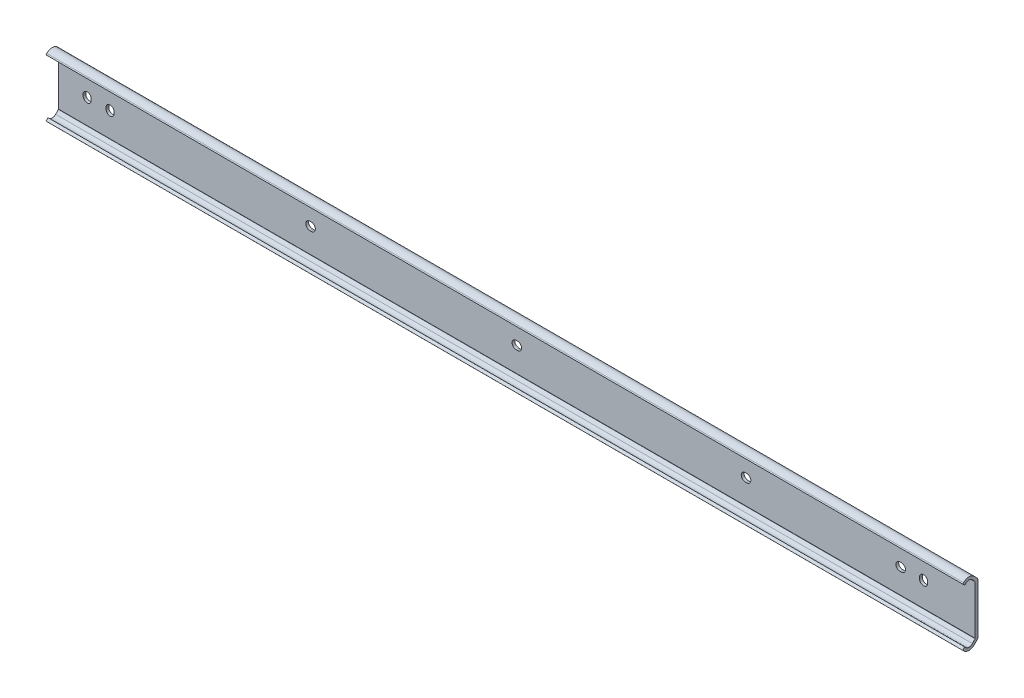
ISO-10303-21;
HEADER;
FILE_DESCRIPTION(('STEP AP214'),'2;1');
FILE_NAME('part.step','',(''),(''),'','','');
FILE_SCHEMA(('AUTOMOTIVE_DESIGN { 1 0 10303 214 1 1 1 1 }'));
ENDSEC;
DATA;
#1=APPLICATION_CONTEXT('core data for automotive mechanical design processes');
#2=APPLICATION_PROTOCOL_DEFINITION('international standard','automotive_design',2000,#1);
#3=PRODUCT_CONTEXT('',#1,'mechanical');
#4=PRODUCT('Part','Part','',(#3));
#5=PRODUCT_RELATED_PRODUCT_CATEGORY('part','',(#4));
#6=PRODUCT_DEFINITION_FORMATION('','',#4);
#7=PRODUCT_DEFINITION_CONTEXT('part definition',#1,'design');
#8=PRODUCT_DEFINITION('design','',#6,#7);
#9=PRODUCT_DEFINITION_SHAPE('','',#8);
#10=(LENGTH_UNIT() NAMED_UNIT(*) SI_UNIT(.MILLI.,.METRE.));
#11=(NAMED_UNIT(*) PLANE_ANGLE_UNIT() SI_UNIT($,.RADIAN.));
#12=(NAMED_UNIT(*) SI_UNIT($,.STERADIAN.) SOLID_ANGLE_UNIT());
#13=UNCERTAINTY_MEASURE_WITH_UNIT(LENGTH_MEASURE(1.E-05),#10,'distance_accuracy_value','');
#14=(GEOMETRIC_REPRESENTATION_CONTEXT(3) GLOBAL_UNCERTAINTY_ASSIGNED_CONTEXT((#13)) GLOBAL_UNIT_ASSIGNED_CONTEXT((#10,
#11,#12)) REPRESENTATION_CONTEXT('',''));
#15=CARTESIAN_POINT('',(0.,0.,0.));
#16=DIRECTION('',(0.,0.,1.));
#17=DIRECTION('',(1.,0.,0.));
#18=AXIS2_PLACEMENT_3D('',#15,#16,#17);
#19=CARTESIAN_POINT('',(491.98217896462,-13.5749999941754,5.00000035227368));
#20=DIRECTION('',(-1.,0.,0.));
#21=DIRECTION('',(0.,0.,-1.));
#22=AXIS2_PLACEMENT_3D('',#19,#20,#21);
#23=CYLINDRICAL_SURFACE('',#22,2.55);
#24=CARTESIAN_POINT('',(-16.0178210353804,-13.5749999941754,5.00000035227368));
#25=DIRECTION('',(-1.,0.,0.));
#26=DIRECTION('',(0.,0.,1.));
#27=AXIS2_PLACEMENT_3D('',#24,#25,#26);
#28=CIRCLE('',#27,2.55);
#29=CARTESIAN_POINT('',(-16.0178210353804,-15.2920516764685,3.11473285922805));
#30=VERTEX_POINT('',#29);
#31=CARTESIAN_POINT('',(-16.0178210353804,-15.2920937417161,6.88522953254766));
#32=VERTEX_POINT('',#31);
#33=EDGE_CURVE('E540',#30,#32,#28,.T.);
#34=ORIENTED_EDGE('',*,*,#33,.T.);
#35=DIRECTION('',(-1.,0.,0.));
#36=VECTOR('',#35,1.);
#37=CARTESIAN_POINT('',(491.98217896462,-15.2920937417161,6.88522953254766));
#38=LINE('',#37,#36);
#39=CARTESIAN_POINT('',(491.98217896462,-15.2920937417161,6.88522953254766));
#40=VERTEX_POINT('',#39);
#41=EDGE_CURVE('E9',#40,#32,#38,.T.);
#42=ORIENTED_EDGE('',*,*,#41,.F.);
#43=CARTESIAN_POINT('',(491.98217896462,-13.5749999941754,5.00000035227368));
#44=DIRECTION('',(-1.,0.,0.));
#45=DIRECTION('',(0.,0.,1.));
#46=AXIS2_PLACEMENT_3D('',#43,#44,#45);
#47=CIRCLE('',#46,2.55);
#48=CARTESIAN_POINT('',(491.98217896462,-15.2920516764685,3.11473285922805));
#49=VERTEX_POINT('',#48);
#50=EDGE_CURVE('E587',#49,#40,#47,.T.);
#51=ORIENTED_EDGE('',*,*,#50,.F.);
#52=DIRECTION('',(-1.,0.,0.));
#53=VECTOR('',#52,1.);
#54=CARTESIAN_POINT('',(491.98217896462,-15.2920516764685,3.11473285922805));
#55=LINE('',#54,#53);
#56=EDGE_CURVE('E628',#49,#30,#55,.T.);
#57=ORIENTED_EDGE('',*,*,#56,.T.);
#58=EDGE_LOOP('',(#34,#42,#51,#57));
#59=FACE_BOUND('',#58,.T.);
#60=ADVANCED_FACE('F14',(#59),#23,.F.);
#61=CARTESIAN_POINT('',(491.98217896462,-15.2920937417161,6.88522953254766));
#62=DIRECTION('',(0.,-0.692409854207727,0.721504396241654));
#63=DIRECTION('',(0.,-0.721504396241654,-0.692409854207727));
#64=AXIS2_PLACEMENT_3D('',#61,#62,#63);
#65=PLANE('',#64);
#66=DIRECTION('',(0.,0.721504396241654,0.692409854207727));
#67=VECTOR('',#66,1.);
#68=CARTESIAN_POINT('',(-16.0178210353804,-15.2920937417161,6.88522953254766));
#69=LINE('',#68,#67);
#70=CARTESIAN_POINT('',(-16.0178210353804,-14.7934623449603,7.36375370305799));
#71=VERTEX_POINT('',#70);
#72=EDGE_CURVE('E549',#32,#71,#69,.T.);
#73=ORIENTED_EDGE('',*,*,#72,.T.);
#74=DIRECTION('',(-1.,0.,0.));
#75=VECTOR('',#74,1.);
#76=CARTESIAN_POINT('',(491.98217896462,-14.7934623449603,7.36375370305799));
#77=LINE('',#76,#75);
#78=CARTESIAN_POINT('',(491.98217896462,-14.7934623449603,7.36375370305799));
#79=VERTEX_POINT('',#78);
#80=EDGE_CURVE('E21',#79,#71,#77,.T.);
#81=ORIENTED_EDGE('',*,*,#80,.F.);
#82=DIRECTION('',(0.,0.721504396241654,0.692409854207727));
#83=VECTOR('',#82,1.);
#84=CARTESIAN_POINT('',(491.98217896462,-15.2920937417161,6.88522953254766));
#85=LINE('',#84,#83);
#86=EDGE_CURVE('E590',#40,#79,#85,.T.);
#87=ORIENTED_EDGE('',*,*,#86,.F.);
#88=ORIENTED_EDGE('',*,*,#41,.T.);
#89=EDGE_LOOP('',(#73,#81,#87,#88));
#90=FACE_BOUND('',#89,.T.);
#91=ADVANCED_FACE('F710',(#90),#65,.F.);
#92=CARTESIAN_POINT('',(491.98217896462,-14.7934623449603,7.36375370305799));
#93=DIRECTION('',(0.,-0.707106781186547,-0.707106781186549));
#94=DIRECTION('',(0.,0.707106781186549,-0.707106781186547));
#95=AXIS2_PLACEMENT_3D('',#92,#93,#94);
#96=PLANE('',#95);
#97=DIRECTION('',(0.,-0.707106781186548,0.707106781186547));
#98=VECTOR('',#97,1.);
#99=CARTESIAN_POINT('',(-16.0178210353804,-14.7934623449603,7.36375370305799));
#100=LINE('',#99,#98);
#101=CARTESIAN_POINT('',(-16.0178210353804,-15.8897093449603,8.46000070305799));
#102=VERTEX_POINT('',#101);
#103=EDGE_CURVE('E551',#71,#102,#100,.T.);
#104=ORIENTED_EDGE('',*,*,#103,.T.);
#105=DIRECTION('',(-1.,0.,0.));
#106=VECTOR('',#105,1.);
#107=CARTESIAN_POINT('',(491.98217896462,-15.8897093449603,8.46000070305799));
#108=LINE('',#107,#106);
#109=CARTESIAN_POINT('',(491.98217896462,-15.8897093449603,8.46000070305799));
#110=VERTEX_POINT('',#109);
#111=EDGE_CURVE('E679',#110,#102,#108,.T.);
#112=ORIENTED_EDGE('',*,*,#111,.F.);
#113=DIRECTION('',(0.,-0.707106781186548,0.707106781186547));
#114=VECTOR('',#113,1.);
#115=CARTESIAN_POINT('',(491.98217896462,-14.7934623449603,7.36375370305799));
#116=LINE('',#115,#114);
#117=EDGE_CURVE('E592',#79,#110,#116,.T.);
#118=ORIENTED_EDGE('',*,*,#117,.F.);
#119=ORIENTED_EDGE('',*,*,#80,.T.);
#120=EDGE_LOOP('',(#104,#112,#118,#119));
#121=FACE_BOUND('',#120,.T.);
#122=ADVANCED_FACE('F686',(#121),#96,.F.);
#123=CARTESIAN_POINT('',(491.98217896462,-16.3524236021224,8.01594474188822));
#124=DIRECTION('',(0.,0.692410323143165,-0.721503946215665));
#125=DIRECTION('',(0.,0.721503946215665,0.692410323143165));
#126=AXIS2_PLACEMENT_3D('',#123,#124,#125);
#127=PLANE('',#126);
#128=DIRECTION('',(0.,-0.721503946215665,-0.692410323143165));
#129=VECTOR('',#128,1.);
#130=CARTESIAN_POINT('',(-16.0178210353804,-16.3524236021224,8.01594474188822));
#131=LINE('',#130,#129);
#132=CARTESIAN_POINT('',(-16.0178210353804,-16.3524236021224,8.01594474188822));
#133=VERTEX_POINT('',#132);
#134=EDGE_CURVE('E553',#102,#133,#131,.T.);
#135=ORIENTED_EDGE('',*,*,#134,.T.);
#136=DIRECTION('',(-1.,0.,0.));
#137=VECTOR('',#136,1.);
#138=CARTESIAN_POINT('',(491.98217896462,-16.3524236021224,8.01594474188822));
#139=LINE('',#138,#137);
#140=CARTESIAN_POINT('',(491.98217896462,-16.3524236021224,8.01594474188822));
#141=VERTEX_POINT('',#140);
#142=EDGE_CURVE('E676',#141,#133,#139,.T.);
#143=ORIENTED_EDGE('',*,*,#142,.F.);
#144=DIRECTION('',(0.,-0.721503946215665,-0.692410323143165));
#145=VECTOR('',#144,1.);
#146=CARTESIAN_POINT('',(491.98217896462,-16.3524236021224,8.01594474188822));
#147=LINE('',#146,#145);
#148=EDGE_CURVE('E594',#110,#141,#147,.T.);
#149=ORIENTED_EDGE('',*,*,#148,.F.);
#150=ORIENTED_EDGE('',*,*,#111,.T.);
#151=EDGE_LOOP('',(#135,#143,#149,#150));
#152=FACE_BOUND('',#151,.T.);
#153=ADVANCED_FACE('F698',(#152),#127,.F.);
#154=CARTESIAN_POINT('',(491.98217896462,-13.5749999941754,5.00000035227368));
#155=DIRECTION('',(-1.,0.,0.));
#156=DIRECTION('',(0.,0.,-1.));
#157=AXIS2_PLACEMENT_3D('',#154,#155,#156);
#158=CYLINDRICAL_SURFACE('',#157,4.10000029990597);
#159=CARTESIAN_POINT('',(-16.0178210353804,-13.5749999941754,5.00000035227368));
#160=DIRECTION('',(1.,0.,0.));
#161=DIRECTION('',(0.,0.,1.));
#162=AXIS2_PLACEMENT_3D('',#159,#160,#161);
#163=CIRCLE('',#162,4.10000029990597);
#164=CARTESIAN_POINT('',(-16.0178210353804,-16.4741380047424,2.10086233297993));
#165=VERTEX_POINT('',#164);
#166=EDGE_CURVE('E555',#133,#165,#163,.T.);
#167=ORIENTED_EDGE('',*,*,#166,.T.);
#168=DIRECTION('',(-1.,0.,0.));
#169=VECTOR('',#168,1.);
#170=CARTESIAN_POINT('',(491.98217896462,-16.4741380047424,2.10086233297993));
#171=LINE('',#170,#169);
#172=CARTESIAN_POINT('',(491.98217896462,-16.4741380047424,2.10086233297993));
#173=VERTEX_POINT('',#172);
#174=EDGE_CURVE('E673',#173,#165,#171,.T.);
#175=ORIENTED_EDGE('',*,*,#174,.F.);
#176=CARTESIAN_POINT('',(491.98217896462,-13.5749999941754,5.00000035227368));
#177=DIRECTION('',(1.,0.,0.));
#178=DIRECTION('',(0.,0.,1.));
#179=AXIS2_PLACEMENT_3D('',#176,#177,#178);
#180=CIRCLE('',#179,4.10000029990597);
#181=EDGE_CURVE('E596',#141,#173,#180,.T.);
#182=ORIENTED_EDGE('',*,*,#181,.F.);
#183=ORIENTED_EDGE('',*,*,#142,.T.);
#184=EDGE_LOOP('',(#167,#175,#182,#183));
#185=FACE_BOUND('',#184,.T.);
#186=ADVANCED_FACE('F702',(#185),#158,.T.);
#187=CARTESIAN_POINT('',(491.98217896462,-16.4741380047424,2.10086233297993));
#188=DIRECTION('',(0.,0.692410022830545,0.721504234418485));
#189=DIRECTION('',(0.,-0.721504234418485,0.692410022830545));
#190=AXIS2_PLACEMENT_3D('',#187,#188,#189);
#191=PLANE('',#190);
#192=DIRECTION('',(0.,0.721504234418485,-0.692410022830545));
#193=VECTOR('',#192,1.);
#194=CARTESIAN_POINT('',(-16.0178210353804,-16.4741380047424,2.10086233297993));
#195=LINE('',#194,#193);
#196=CARTESIAN_POINT('',(-16.0178210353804,-14.8073561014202,0.501292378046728));
#197=VERTEX_POINT('',#196);
#198=EDGE_CURVE('E557',#165,#197,#195,.T.);
#199=ORIENTED_EDGE('',*,*,#198,.T.);
#200=DIRECTION('',(-1.,0.,0.));
#201=VECTOR('',#200,1.);
#202=CARTESIAN_POINT('',(491.98217896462,-14.8073561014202,0.501292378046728));
#203=LINE('',#202,#201);
#204=CARTESIAN_POINT('',(491.98217896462,-14.8073561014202,0.501292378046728));
#205=VERTEX_POINT('',#204);
#206=EDGE_CURVE('E670',#205,#197,#203,.T.);
#207=ORIENTED_EDGE('',*,*,#206,.F.);
#208=DIRECTION('',(0.,0.721504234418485,-0.692410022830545));
#209=VECTOR('',#208,1.);
#210=CARTESIAN_POINT('',(491.98217896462,-16.4741380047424,2.10086233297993));
#211=LINE('',#210,#209);
#212=EDGE_CURVE('E598',#173,#205,#211,.T.);
#213=ORIENTED_EDGE('',*,*,#212,.F.);
#214=ORIENTED_EDGE('',*,*,#174,.T.);
#215=EDGE_LOOP('',(#199,#207,#213,#214));
#216=FACE_BOUND('',#215,.T.);
#217=ADVANCED_FACE('F781',(#216),#191,.F.);
#218=CARTESIAN_POINT('',(491.98217896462,-13.5610180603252,1.8));
#219=DIRECTION('',(-1.,0.,0.));
#220=DIRECTION('',(0.,0.,-1.));
#221=AXIS2_PLACEMENT_3D('',#218,#219,#220);
#222=CYLINDRICAL_SURFACE('',#221,1.8);
#223=CARTESIAN_POINT('',(-16.0178210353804,-13.5610180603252,1.8));
#224=DIRECTION('',(1.,0.,0.));
#225=DIRECTION('',(0.,0.,1.));
#226=AXIS2_PLACEMENT_3D('',#223,#224,#225);
#227=CIRCLE('',#226,1.8);
#228=CARTESIAN_POINT('',(-16.0178210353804,-13.5610180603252,0.));
#229=VERTEX_POINT('',#228);
#230=EDGE_CURVE('E559',#197,#229,#227,.T.);
#231=ORIENTED_EDGE('',*,*,#230,.T.);
#232=DIRECTION('',(-1.,0.,0.));
#233=VECTOR('',#232,1.);
#234=CARTESIAN_POINT('',(491.98217896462,-13.5610180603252,0.));
#235=LINE('',#234,#233);
#236=CARTESIAN_POINT('',(491.98217896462,-13.5610180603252,0.));
#237=VERTEX_POINT('',#236);
#238=EDGE_CURVE('E667',#237,#229,#235,.T.);
#239=ORIENTED_EDGE('',*,*,#238,.F.);
#240=CARTESIAN_POINT('',(491.98217896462,-13.5610180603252,1.8));
#241=DIRECTION('',(1.,0.,0.));
#242=DIRECTION('',(0.,0.,1.));
#243=AXIS2_PLACEMENT_3D('',#240,#241,#242);
#244=CIRCLE('',#243,1.8);
#245=EDGE_CURVE('E600',#205,#237,#244,.T.);
#246=ORIENTED_EDGE('',*,*,#245,.F.);
#247=ORIENTED_EDGE('',*,*,#206,.T.);
#248=EDGE_LOOP('',(#231,#239,#246,#247));
#249=FACE_BOUND('',#248,.T.);
#250=ADVANCED_FACE('F779',(#249),#222,.T.);
#251=CARTESIAN_POINT('',(491.98217896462,13.5610180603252,0.));
#252=DIRECTION('',(0.,0.,1.));
#253=DIRECTION('',(-1.,0.,0.));
#254=AXIS2_PLACEMENT_3D('',#251,#252,#253);
#255=PLANE('',#254);
#256=DIRECTION('',(0.,1.,0.));
#257=VECTOR('',#256,1.);
#258=CARTESIAN_POINT('',(14.8321789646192,-0.399999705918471,0.));
#259=LINE('',#258,#257);
#260=CARTESIAN_POINT('',(14.8321789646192,-0.399999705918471,0.));
#261=VERTEX_POINT('',#260);
#262=CARTESIAN_POINT('',(14.8321789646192,0.400000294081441,0.));
#263=VERTEX_POINT('',#262);
#264=EDGE_CURVE('E347',#261,#263,#259,.T.);
#265=ORIENTED_EDGE('',*,*,#264,.T.);
#266=CARTESIAN_POINT('',(12.5821789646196,0.400000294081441,0.));
#267=DIRECTION('',(0.,0.,1.));
#268=DIRECTION('',(-1.,0.,0.));
#269=AXIS2_PLACEMENT_3D('',#266,#267,#268);
#270=CIRCLE('',#269,2.24999999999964);
#271=CARTESIAN_POINT('',(10.33217896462,0.400000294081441,0.));
#272=VERTEX_POINT('',#271);
#273=EDGE_CURVE('E338',#263,#272,#270,.T.);
#274=ORIENTED_EDGE('',*,*,#273,.T.);
#275=DIRECTION('',(0.,-1.,0.));
#276=VECTOR('',#275,1.);
#277=CARTESIAN_POINT('',(10.33217896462,-0.399999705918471,0.));
#278=LINE('',#277,#276);
#279=CARTESIAN_POINT('',(10.33217896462,-0.399999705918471,0.));
#280=VERTEX_POINT('',#279);
#281=EDGE_CURVE('E344',#272,#280,#278,.T.);
#282=ORIENTED_EDGE('',*,*,#281,.T.);
#283=CARTESIAN_POINT('',(12.5821789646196,-0.399999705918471,0.));
#284=DIRECTION('',(0.,0.,1.));
#285=DIRECTION('',(-1.,0.,0.));
#286=AXIS2_PLACEMENT_3D('',#283,#284,#285);
#287=CIRCLE('',#286,2.24999999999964);
#288=EDGE_CURVE('E28',#280,#261,#287,.T.);
#289=ORIENTED_EDGE('',*,*,#288,.T.);
#290=EDGE_LOOP('',(#265,#274,#282,#289));
#291=FACE_BOUND('',#290,.T.);
#292=DIRECTION('',(0.,-1.,0.));
#293=VECTOR('',#292,1.);
#294=CARTESIAN_POINT('',(-2.36782103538,-0.399999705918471,0.));
#295=LINE('',#294,#293);
#296=CARTESIAN_POINT('',(-2.36782103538,0.400000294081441,0.));
#297=VERTEX_POINT('',#296);
#298=CARTESIAN_POINT('',(-2.36782103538,-0.399999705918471,0.));
#299=VERTEX_POINT('',#298);
#300=EDGE_CURVE('E374',#297,#299,#295,.T.);
#301=ORIENTED_EDGE('',*,*,#300,.T.);
#302=CARTESIAN_POINT('',(-0.117821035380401,-0.399999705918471,0.));
#303=DIRECTION('',(0.,0.,1.));
#304=DIRECTION('',(-1.,0.,0.));
#305=AXIS2_PLACEMENT_3D('',#302,#303,#304);
#306=CIRCLE('',#305,2.24999999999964);
#307=CARTESIAN_POINT('',(2.13217896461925,-0.399999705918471,0.));
#308=VERTEX_POINT('',#307);
#309=EDGE_CURVE('E365',#299,#308,#306,.T.);
#310=ORIENTED_EDGE('',*,*,#309,.T.);
#311=DIRECTION('',(0.,1.,0.));
#312=VECTOR('',#311,1.);
#313=CARTESIAN_POINT('',(2.13217896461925,-0.399999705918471,0.));
#314=LINE('',#313,#312);
#315=CARTESIAN_POINT('',(2.13217896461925,0.400000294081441,0.));
#316=VERTEX_POINT('',#315);
#317=EDGE_CURVE('E368',#308,#316,#314,.T.);
#318=ORIENTED_EDGE('',*,*,#317,.T.);
#319=CARTESIAN_POINT('',(-0.117821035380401,0.400000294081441,0.));
#320=DIRECTION('',(0.,0.,1.));
#321=DIRECTION('',(-1.,0.,0.));
#322=AXIS2_PLACEMENT_3D('',#319,#320,#321);
#323=CIRCLE('',#322,2.24999999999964);
#324=EDGE_CURVE('E371',#316,#297,#323,.T.);
#325=ORIENTED_EDGE('',*,*,#324,.T.);
#326=EDGE_LOOP('',(#301,#310,#318,#325));
#327=FACE_BOUND('',#326,.T.);
#328=DIRECTION('',(1.,0.,0.));
#329=VECTOR('',#328,1.);
#330=CARTESIAN_POINT('',(238.382534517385,-2.24999797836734,0.));
#331=LINE('',#330,#329);
#332=CARTESIAN_POINT('',(237.582534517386,-2.24999797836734,0.));
#333=VERTEX_POINT('',#332);
#334=CARTESIAN_POINT('',(238.382534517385,-2.24999797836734,0.));
#335=VERTEX_POINT('',#334);
#336=EDGE_CURVE('E406',#333,#335,#331,.T.);
#337=ORIENTED_EDGE('',*,*,#336,.T.);
#338=CARTESIAN_POINT('',(238.382534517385,2.02163262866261E-06,0.));
#339=DIRECTION('',(0.,0.,1.));
#340=DIRECTION('',(-1.,0.,0.));
#341=AXIS2_PLACEMENT_3D('',#338,#339,#340);
#342=CIRCLE('',#341,2.24999999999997);
#343=CARTESIAN_POINT('',(238.382534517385,2.2500020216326,0.));
#344=VERTEX_POINT('',#343);
#345=EDGE_CURVE('E397',#335,#344,#342,.T.);
#346=ORIENTED_EDGE('',*,*,#345,.T.);
#347=DIRECTION('',(-1.,0.,0.));
#348=VECTOR('',#347,1.);
#349=CARTESIAN_POINT('',(238.382534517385,2.2500020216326,0.));
#350=LINE('',#349,#348);
#351=CARTESIAN_POINT('',(237.582534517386,2.2500020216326,0.));
#352=VERTEX_POINT('',#351);
#353=EDGE_CURVE('E400',#344,#352,#350,.T.);
#354=ORIENTED_EDGE('',*,*,#353,.T.);
#355=CARTESIAN_POINT('',(237.582534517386,2.02163262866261E-06,0.));
#356=DIRECTION('',(0.,0.,1.));
#357=DIRECTION('',(-1.,0.,0.));
#358=AXIS2_PLACEMENT_3D('',#355,#356,#357);
#359=CIRCLE('',#358,2.24999999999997);
#360=EDGE_CURVE('E403',#352,#333,#359,.T.);
#361=ORIENTED_EDGE('',*,*,#360,.T.);
#362=EDGE_LOOP('',(#337,#346,#354,#361));
#363=FACE_BOUND('',#362,.T.);
#364=DIRECTION('',(1.,-1.05167610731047E-13,0.));
#365=VECTOR('',#364,1.);
#366=CARTESIAN_POINT('',(365.382178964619,-2.24999970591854,0.));
#367=LINE('',#366,#365);
#368=CARTESIAN_POINT('',(364.582178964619,-2.24999970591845,0.));
#369=VERTEX_POINT('',#368);
#370=CARTESIAN_POINT('',(365.382178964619,-2.24999970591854,0.));
#371=VERTEX_POINT('',#370);
#372=EDGE_CURVE('E438',#369,#371,#367,.T.);
#373=ORIENTED_EDGE('',*,*,#372,.T.);
#374=CARTESIAN_POINT('',(365.382178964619,2.94081439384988E-07,0.));
#375=DIRECTION('',(0.,0.,1.));
#376=DIRECTION('',(-1.,0.,0.));
#377=AXIS2_PLACEMENT_3D('',#374,#375,#376);
#378=CIRCLE('',#377,2.24999999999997);
#379=CARTESIAN_POINT('',(365.382178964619,2.25000029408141,0.));
#380=VERTEX_POINT('',#379);
#381=EDGE_CURVE('E429',#371,#380,#378,.T.);
#382=ORIENTED_EDGE('',*,*,#381,.T.);
#383=DIRECTION('',(-1.,0.,0.));
#384=VECTOR('',#383,1.);
#385=CARTESIAN_POINT('',(365.382178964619,2.25000029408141,0.));
#386=LINE('',#385,#384);
#387=CARTESIAN_POINT('',(364.582178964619,2.25000029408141,0.));
#388=VERTEX_POINT('',#387);
#389=EDGE_CURVE('E432',#380,#388,#386,.T.);
#390=ORIENTED_EDGE('',*,*,#389,.T.);
#391=CARTESIAN_POINT('',(364.582178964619,2.94081481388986E-07,0.));
#392=DIRECTION('',(0.,0.,1.));
#393=DIRECTION('',(-1.,0.,0.));
#394=AXIS2_PLACEMENT_3D('',#391,#392,#393);
#395=CIRCLE('',#394,2.24999999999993);
#396=EDGE_CURVE('E435',#388,#369,#395,.T.);
#397=ORIENTED_EDGE('',*,*,#396,.T.);
#398=EDGE_LOOP('',(#373,#382,#390,#397));
#399=FACE_BOUND('',#398,.T.);
#400=DIRECTION('',(1.,0.,0.));
#401=VECTOR('',#400,1.);
#402=CARTESIAN_POINT('',(451.08217896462,-2.2499997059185,0.));
#403=LINE('',#402,#401);
#404=CARTESIAN_POINT('',(450.28217896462,-2.24999970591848,0.));
#405=VERTEX_POINT('',#404);
#406=CARTESIAN_POINT('',(451.08217896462,-2.2499997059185,0.));
#407=VERTEX_POINT('',#406);
#408=EDGE_CURVE('E470',#405,#407,#403,.T.);
#409=ORIENTED_EDGE('',*,*,#408,.T.);
#410=CARTESIAN_POINT('',(451.08217896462,2.9408147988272E-07,0.));
#411=DIRECTION('',(0.,0.,1.));
#412=DIRECTION('',(-1.,0.,0.));
#413=AXIS2_PLACEMENT_3D('',#410,#411,#412);
#414=CIRCLE('',#413,2.24999999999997);
#415=CARTESIAN_POINT('',(451.08217896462,2.25000029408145,0.));
#416=VERTEX_POINT('',#415);
#417=EDGE_CURVE('E461',#407,#416,#414,.T.);
#418=ORIENTED_EDGE('',*,*,#417,.T.);
#419=DIRECTION('',(-1.,0.,0.));
#420=VECTOR('',#419,1.);
#421=CARTESIAN_POINT('',(451.08217896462,2.25000029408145,0.));
#422=LINE('',#421,#420);
#423=CARTESIAN_POINT('',(450.28217896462,2.25000029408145,0.));
#424=VERTEX_POINT('',#423);
#425=EDGE_CURVE('E464',#416,#424,#422,.T.);
#426=ORIENTED_EDGE('',*,*,#425,.T.);
#427=CARTESIAN_POINT('',(450.28217896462,2.94081484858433E-07,0.));
#428=DIRECTION('',(0.,0.,1.));
#429=DIRECTION('',(-1.,0.,0.));
#430=AXIS2_PLACEMENT_3D('',#427,#428,#429);
#431=CIRCLE('',#430,2.24999999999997);
#432=EDGE_CURVE('E467',#424,#405,#431,.T.);
#433=ORIENTED_EDGE('',*,*,#432,.T.);
#434=EDGE_LOOP('',(#409,#418,#426,#433));
#435=FACE_BOUND('',#434,.T.);
#436=DIRECTION('',(0.,1.,0.));
#437=VECTOR('',#436,1.);
#438=CARTESIAN_POINT('',(465.63217896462,-0.399999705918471,0.));
#439=LINE('',#438,#437);
#440=CARTESIAN_POINT('',(465.63217896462,-0.399999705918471,0.));
#441=VERTEX_POINT('',#440);
#442=CARTESIAN_POINT('',(465.63217896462,0.400000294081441,0.));
#443=VERTEX_POINT('',#442);
#444=EDGE_CURVE('E502',#441,#443,#439,.T.);
#445=ORIENTED_EDGE('',*,*,#444,.T.);
#446=CARTESIAN_POINT('',(463.38217896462,0.400000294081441,0.));
#447=DIRECTION('',(0.,0.,1.));
#448=DIRECTION('',(-1.,0.,0.));
#449=AXIS2_PLACEMENT_3D('',#446,#447,#448);
#450=CIRCLE('',#449,2.24999999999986);
#451=CARTESIAN_POINT('',(461.13217896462,0.40000029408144,0.));
#452=VERTEX_POINT('',#451);
#453=EDGE_CURVE('E493',#443,#452,#450,.T.);
#454=ORIENTED_EDGE('',*,*,#453,.T.);
#455=DIRECTION('',(0.,-1.,0.));
#456=VECTOR('',#455,1.);
#457=CARTESIAN_POINT('',(461.13217896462,-0.399999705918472,0.));
#458=LINE('',#457,#456);
#459=CARTESIAN_POINT('',(461.13217896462,-0.399999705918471,0.));
#460=VERTEX_POINT('',#459);
#461=EDGE_CURVE('E496',#452,#460,#458,.T.);
#462=ORIENTED_EDGE('',*,*,#461,.T.);
#463=CARTESIAN_POINT('',(463.38217896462,-0.399999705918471,0.));
#464=DIRECTION('',(0.,0.,1.));
#465=DIRECTION('',(-1.,0.,0.));
#466=AXIS2_PLACEMENT_3D('',#463,#464,#465);
#467=CIRCLE('',#466,2.24999999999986);
#468=EDGE_CURVE('E499',#460,#441,#467,.T.);
#469=ORIENTED_EDGE('',*,*,#468,.T.);
#470=EDGE_LOOP('',(#445,#454,#462,#469));
#471=FACE_BOUND('',#470,.T.);
#472=DIRECTION('',(1.,0.,0.));
#473=VECTOR('',#472,1.);
#474=CARTESIAN_POINT('',(124.08217896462,-2.24999797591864,0.));
#475=LINE('',#474,#473);
#476=CARTESIAN_POINT('',(123.28217896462,-2.24999797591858,0.));
#477=VERTEX_POINT('',#476);
#478=CARTESIAN_POINT('',(124.08217896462,-2.24999797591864,0.));
#479=VERTEX_POINT('',#478);
#480=EDGE_CURVE('E534',#477,#479,#475,.T.);
#481=ORIENTED_EDGE('',*,*,#480,.T.);
#482=CARTESIAN_POINT('',(124.08217896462,2.02408134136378E-06,0.));
#483=DIRECTION('',(0.,0.,1.));
#484=DIRECTION('',(-1.,0.,0.));
#485=AXIS2_PLACEMENT_3D('',#482,#483,#484);
#486=CIRCLE('',#485,2.24999999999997);
#487=CARTESIAN_POINT('',(124.08217896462,2.25000202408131,0.));
#488=VERTEX_POINT('',#487);
#489=EDGE_CURVE('E525',#479,#488,#486,.T.);
#490=ORIENTED_EDGE('',*,*,#489,.T.);
#491=DIRECTION('',(-1.,0.,0.));
#492=VECTOR('',#491,1.);
#493=CARTESIAN_POINT('',(124.08217896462,2.25000202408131,0.));
#494=LINE('',#493,#492);
#495=CARTESIAN_POINT('',(123.28217896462,2.25000202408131,0.));
#496=VERTEX_POINT('',#495);
#497=EDGE_CURVE('E528',#488,#496,#494,.T.);
#498=ORIENTED_EDGE('',*,*,#497,.T.);
#499=CARTESIAN_POINT('',(123.28217896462,2.0240813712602E-06,0.));
#500=DIRECTION('',(0.,0.,1.));
#501=DIRECTION('',(-1.,0.,0.));
#502=AXIS2_PLACEMENT_3D('',#499,#500,#501);
#503=CIRCLE('',#502,2.24999999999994);
#504=EDGE_CURVE('E531',#496,#477,#503,.T.);
#505=ORIENTED_EDGE('',*,*,#504,.T.);
#506=EDGE_LOOP('',(#481,#490,#498,#505));
#507=FACE_BOUND('',#506,.T.);
#508=DIRECTION('',(0.,1.,0.));
#509=VECTOR('',#508,1.);
#510=CARTESIAN_POINT('',(-16.0178210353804,13.5610180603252,0.));
#511=LINE('',#510,#509);
#512=CARTESIAN_POINT('',(-16.0178210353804,13.5610180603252,0.));
#513=VERTEX_POINT('',#512);
#514=EDGE_CURVE('E561',#229,#513,#511,.T.);
#515=ORIENTED_EDGE('',*,*,#514,.T.);
#516=DIRECTION('',(-1.,0.,0.));
#517=VECTOR('',#516,1.);
#518=CARTESIAN_POINT('',(491.98217896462,13.5610180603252,0.));
#519=LINE('',#518,#517);
#520=CARTESIAN_POINT('',(491.98217896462,13.5610180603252,0.));
#521=VERTEX_POINT('',#520);
#522=EDGE_CURVE('E664',#521,#513,#519,.T.);
#523=ORIENTED_EDGE('',*,*,#522,.F.);
#524=DIRECTION('',(0.,1.,0.));
#525=VECTOR('',#524,1.);
#526=CARTESIAN_POINT('',(491.98217896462,13.5610180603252,0.));
#527=LINE('',#526,#525);
#528=EDGE_CURVE('E602',#237,#521,#527,.T.);
#529=ORIENTED_EDGE('',*,*,#528,.F.);
#530=ORIENTED_EDGE('',*,*,#238,.T.);
#531=EDGE_LOOP('',(#515,#523,#529,#530));
#532=FACE_BOUND('',#531,.T.);
#533=ADVANCED_FACE('F774',(#291,#327,#363,#399,#435,#471,#507,#532),#255,.F.);
#534=CARTESIAN_POINT('',(491.98217896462,13.5610180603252,1.8));
#535=DIRECTION('',(-1.,0.,0.));
#536=DIRECTION('',(0.,0.,-1.));
#537=AXIS2_PLACEMENT_3D('',#534,#535,#536);
#538=CYLINDRICAL_SURFACE('',#537,1.8);
#539=CARTESIAN_POINT('',(-16.0178210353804,13.5610180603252,1.8));
#540=DIRECTION('',(1.,0.,0.));
#541=DIRECTION('',(0.,0.,-1.));
#542=AXIS2_PLACEMENT_3D('',#539,#540,#541);
#543=CIRCLE('',#542,1.8);
#544=CARTESIAN_POINT('',(-16.0178210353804,14.8073561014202,0.501292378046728));
#545=VERTEX_POINT('',#544);
#546=EDGE_CURVE('E563',#513,#545,#543,.T.);
#547=ORIENTED_EDGE('',*,*,#546,.T.);
#548=DIRECTION('',(-1.,0.,0.));
#549=VECTOR('',#548,1.);
#550=CARTESIAN_POINT('',(491.98217896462,14.8073561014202,0.501292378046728));
#551=LINE('',#550,#549);
#552=CARTESIAN_POINT('',(491.98217896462,14.8073561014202,0.501292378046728));
#553=VERTEX_POINT('',#552);
#554=EDGE_CURVE('E661',#553,#545,#551,.T.);
#555=ORIENTED_EDGE('',*,*,#554,.F.);
#556=CARTESIAN_POINT('',(491.98217896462,13.5610180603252,1.8));
#557=DIRECTION('',(1.,0.,0.));
#558=DIRECTION('',(0.,0.,-1.));
#559=AXIS2_PLACEMENT_3D('',#556,#557,#558);
#560=CIRCLE('',#559,1.8);
#561=EDGE_CURVE('E604',#521,#553,#560,.T.);
#562=ORIENTED_EDGE('',*,*,#561,.F.);
#563=ORIENTED_EDGE('',*,*,#522,.T.);
#564=EDGE_LOOP('',(#547,#555,#562,#563));
#565=FACE_BOUND('',#564,.T.);
#566=ADVANCED_FACE('F769',(#565),#538,.T.);
#567=CARTESIAN_POINT('',(491.98217896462,16.4741380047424,2.10086233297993));
#568=DIRECTION('',(0.,-0.692410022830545,0.721504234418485));
#569=DIRECTION('',(0.,-0.721504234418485,-0.692410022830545));
#570=AXIS2_PLACEMENT_3D('',#567,#568,#569);
#571=PLANE('',#570);
#572=DIRECTION('',(0.,0.721504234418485,0.692410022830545));
#573=VECTOR('',#572,1.);
#574=CARTESIAN_POINT('',(-16.0178210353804,16.4741380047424,2.10086233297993));
#575=LINE('',#574,#573);
#576=CARTESIAN_POINT('',(-16.0178210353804,16.4741380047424,2.10086233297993));
#577=VERTEX_POINT('',#576);
#578=EDGE_CURVE('E565',#545,#577,#575,.T.);
#579=ORIENTED_EDGE('',*,*,#578,.T.);
#580=DIRECTION('',(-1.,0.,0.));
#581=VECTOR('',#580,1.);
#582=CARTESIAN_POINT('',(491.98217896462,16.4741380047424,2.10086233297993));
#583=LINE('',#582,#581);
#584=CARTESIAN_POINT('',(491.98217896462,16.4741380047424,2.10086233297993));
#585=VERTEX_POINT('',#584);
#586=EDGE_CURVE('E658',#585,#577,#583,.T.);
#587=ORIENTED_EDGE('',*,*,#586,.F.);
#588=DIRECTION('',(0.,0.721504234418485,0.692410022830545));
#589=VECTOR('',#588,1.);
#590=CARTESIAN_POINT('',(491.98217896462,16.4741380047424,2.10086233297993));
#591=LINE('',#590,#589);
#592=EDGE_CURVE('E606',#553,#585,#591,.T.);
#593=ORIENTED_EDGE('',*,*,#592,.F.);
#594=ORIENTED_EDGE('',*,*,#554,.T.);
#595=EDGE_LOOP('',(#579,#587,#593,#594));
#596=FACE_BOUND('',#595,.T.);
#597=ADVANCED_FACE('F765',(#596),#571,.F.);
#598=CARTESIAN_POINT('',(491.98217896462,13.5749999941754,5.00000035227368));
#599=DIRECTION('',(-1.,0.,0.));
#600=DIRECTION('',(0.,0.,-1.));
#601=AXIS2_PLACEMENT_3D('',#598,#599,#600);
#602=CYLINDRICAL_SURFACE('',#601,4.10000029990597);
#603=CARTESIAN_POINT('',(-16.0178210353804,13.5749999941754,5.00000035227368));
#604=DIRECTION('',(1.,0.,0.));
#605=DIRECTION('',(0.,0.,-1.));
#606=AXIS2_PLACEMENT_3D('',#603,#604,#605);
#607=CIRCLE('',#606,4.10000029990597);
#608=CARTESIAN_POINT('',(-16.0178210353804,16.3524236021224,8.01594474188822));
#609=VERTEX_POINT('',#608);
#610=EDGE_CURVE('E567',#577,#609,#607,.T.);
#611=ORIENTED_EDGE('',*,*,#610,.T.);
#612=DIRECTION('',(-1.,0.,0.));
#613=VECTOR('',#612,1.);
#614=CARTESIAN_POINT('',(491.98217896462,16.3524236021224,8.01594474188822));
#615=LINE('',#614,#613);
#616=CARTESIAN_POINT('',(491.98217896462,16.3524236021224,8.01594474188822));
#617=VERTEX_POINT('',#616);
#618=EDGE_CURVE('E655',#617,#609,#615,.T.);
#619=ORIENTED_EDGE('',*,*,#618,.F.);
#620=CARTESIAN_POINT('',(491.98217896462,13.5749999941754,5.00000035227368));
#621=DIRECTION('',(1.,0.,0.));
#622=DIRECTION('',(0.,0.,-1.));
#623=AXIS2_PLACEMENT_3D('',#620,#621,#622);
#624=CIRCLE('',#623,4.10000029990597);
#625=EDGE_CURVE('E608',#585,#617,#624,.T.);
#626=ORIENTED_EDGE('',*,*,#625,.F.);
#627=ORIENTED_EDGE('',*,*,#586,.T.);
#628=EDGE_LOOP('',(#611,#619,#626,#627));
#629=FACE_BOUND('',#628,.T.);
#630=ADVANCED_FACE('F760',(#629),#602,.T.);
#631=CARTESIAN_POINT('',(491.98217896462,16.3524236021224,8.01594474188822));
#632=DIRECTION('',(0.,-0.692410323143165,-0.721503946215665));
#633=DIRECTION('',(0.,0.721503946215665,-0.692410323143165));
#634=AXIS2_PLACEMENT_3D('',#631,#632,#633);
#635=PLANE('',#634);
#636=DIRECTION('',(0.,-0.721503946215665,0.692410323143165));
#637=VECTOR('',#636,1.);
#638=CARTESIAN_POINT('',(-16.0178210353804,16.3524236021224,8.01594474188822));
#639=LINE('',#638,#637);
#640=CARTESIAN_POINT('',(-16.0178210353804,15.8897093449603,8.46000070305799));
#641=VERTEX_POINT('',#640);
#642=EDGE_CURVE('E569',#609,#641,#639,.T.);
#643=ORIENTED_EDGE('',*,*,#642,.T.);
#644=DIRECTION('',(-1.,0.,0.));
#645=VECTOR('',#644,1.);
#646=CARTESIAN_POINT('',(491.98217896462,15.8897093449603,8.46000070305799));
#647=LINE('',#646,#645);
#648=CARTESIAN_POINT('',(491.98217896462,15.8897093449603,8.46000070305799));
#649=VERTEX_POINT('',#648);
#650=EDGE_CURVE('E652',#649,#641,#647,.T.);
#651=ORIENTED_EDGE('',*,*,#650,.F.);
#652=DIRECTION('',(0.,-0.721503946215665,0.692410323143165));
#653=VECTOR('',#652,1.);
#654=CARTESIAN_POINT('',(491.98217896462,16.3524236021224,8.01594474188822));
#655=LINE('',#654,#653);
#656=EDGE_CURVE('E610',#617,#649,#655,.T.);
#657=ORIENTED_EDGE('',*,*,#656,.F.);
#658=ORIENTED_EDGE('',*,*,#618,.T.);
#659=EDGE_LOOP('',(#643,#651,#657,#658));
#660=FACE_BOUND('',#659,.T.);
#661=ADVANCED_FACE('F754',(#660),#635,.F.);
#662=CARTESIAN_POINT('',(491.98217896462,14.7934623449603,7.36375370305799));
#663=DIRECTION('',(0.,0.707106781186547,-0.707106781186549));
#664=DIRECTION('',(0.,0.707106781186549,0.707106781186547));
#665=AXIS2_PLACEMENT_3D('',#662,#663,#664);
#666=PLANE('',#665);
#667=DIRECTION('',(0.,-0.707106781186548,-0.707106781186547));
#668=VECTOR('',#667,1.);
#669=CARTESIAN_POINT('',(-16.0178210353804,14.7934623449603,7.36375370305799));
#670=LINE('',#669,#668);
#671=CARTESIAN_POINT('',(-16.0178210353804,14.7934623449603,7.36375370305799));
#672=VERTEX_POINT('',#671);
#673=EDGE_CURVE('E571',#641,#672,#670,.T.);
#674=ORIENTED_EDGE('',*,*,#673,.T.);
#675=DIRECTION('',(-1.,0.,0.));
#676=VECTOR('',#675,1.);
#677=CARTESIAN_POINT('',(491.98217896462,14.7934623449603,7.36375370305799));
#678=LINE('',#677,#676);
#679=CARTESIAN_POINT('',(491.98217896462,14.7934623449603,7.36375370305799));
#680=VERTEX_POINT('',#679);
#681=EDGE_CURVE('E649',#680,#672,#678,.T.);
#682=ORIENTED_EDGE('',*,*,#681,.F.);
#683=DIRECTION('',(0.,-0.707106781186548,-0.707106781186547));
#684=VECTOR('',#683,1.);
#685=CARTESIAN_POINT('',(491.98217896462,14.7934623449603,7.36375370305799));
#686=LINE('',#685,#684);
#687=EDGE_CURVE('E612',#649,#680,#686,.T.);
#688=ORIENTED_EDGE('',*,*,#687,.F.);
#689=ORIENTED_EDGE('',*,*,#650,.T.);
#690=EDGE_LOOP('',(#674,#682,#688,#689));
#691=FACE_BOUND('',#690,.T.);
#692=ADVANCED_FACE('F750',(#691),#666,.F.);
#693=CARTESIAN_POINT('',(491.98217896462,15.2920937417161,6.88522953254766));
#694=DIRECTION('',(0.,0.692409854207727,0.721504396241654));
#695=DIRECTION('',(0.,-0.721504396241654,0.692409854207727));
#696=AXIS2_PLACEMENT_3D('',#693,#694,#695);
#697=PLANE('',#696);
#698=DIRECTION('',(0.,0.721504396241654,-0.692409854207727));
#699=VECTOR('',#698,1.);
#700=CARTESIAN_POINT('',(-16.0178210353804,15.2920937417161,6.88522953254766));
#701=LINE('',#700,#699);
#702=CARTESIAN_POINT('',(-16.0178210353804,15.2920937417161,6.88522953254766));
#703=VERTEX_POINT('',#702);
#704=EDGE_CURVE('E573',#672,#703,#701,.T.);
#705=ORIENTED_EDGE('',*,*,#704,.T.);
#706=DIRECTION('',(-1.,0.,0.));
#707=VECTOR('',#706,1.);
#708=CARTESIAN_POINT('',(491.98217896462,15.2920937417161,6.88522953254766));
#709=LINE('',#708,#707);
#710=CARTESIAN_POINT('',(491.98217896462,15.2920937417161,6.88522953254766));
#711=VERTEX_POINT('',#710);
#712=EDGE_CURVE('E646',#711,#703,#709,.T.);
#713=ORIENTED_EDGE('',*,*,#712,.F.);
#714=DIRECTION('',(0.,0.721504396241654,-0.692409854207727));
#715=VECTOR('',#714,1.);
#716=CARTESIAN_POINT('',(491.98217896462,15.2920937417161,6.88522953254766));
#717=LINE('',#716,#715);
#718=EDGE_CURVE('E614',#680,#711,#717,.T.);
#719=ORIENTED_EDGE('',*,*,#718,.F.);
#720=ORIENTED_EDGE('',*,*,#681,.T.);
#721=EDGE_LOOP('',(#705,#713,#719,#720));
#722=FACE_BOUND('',#721,.T.);
#723=ADVANCED_FACE('F745',(#722),#697,.F.);
#724=CARTESIAN_POINT('',(491.98217896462,13.5749999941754,5.00000035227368));
#725=DIRECTION('',(-1.,0.,0.));
#726=DIRECTION('',(0.,0.,-1.));
#727=AXIS2_PLACEMENT_3D('',#724,#725,#726);
#728=CYLINDRICAL_SURFACE('',#727,2.55);
#729=CARTESIAN_POINT('',(-16.0178210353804,13.5749999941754,5.00000035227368));
#730=DIRECTION('',(-1.,0.,0.));
#731=DIRECTION('',(0.,0.,-1.));
#732=AXIS2_PLACEMENT_3D('',#729,#730,#731);
#733=CIRCLE('',#732,2.55);
#734=CARTESIAN_POINT('',(-16.0178210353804,15.2920516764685,3.11473285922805));
#735=VERTEX_POINT('',#734);
#736=EDGE_CURVE('E575',#703,#735,#733,.T.);
#737=ORIENTED_EDGE('',*,*,#736,.T.);
#738=DIRECTION('',(-1.,0.,0.));
#739=VECTOR('',#738,1.);
#740=CARTESIAN_POINT('',(491.98217896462,15.2920516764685,3.11473285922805));
#741=LINE('',#740,#739);
#742=CARTESIAN_POINT('',(491.98217896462,15.2920516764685,3.11473285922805));
#743=VERTEX_POINT('',#742);
#744=EDGE_CURVE('E643',#743,#735,#741,.T.);
#745=ORIENTED_EDGE('',*,*,#744,.F.);
#746=CARTESIAN_POINT('',(491.98217896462,13.5749999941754,5.00000035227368));
#747=DIRECTION('',(-1.,0.,0.));
#748=DIRECTION('',(0.,0.,-1.));
#749=AXIS2_PLACEMENT_3D('',#746,#747,#748);
#750=CIRCLE('',#749,2.55);
#751=EDGE_CURVE('E616',#711,#743,#750,.T.);
#752=ORIENTED_EDGE('',*,*,#751,.F.);
#753=ORIENTED_EDGE('',*,*,#712,.T.);
#754=EDGE_LOOP('',(#737,#745,#752,#753));
#755=FACE_BOUND('',#754,.T.);
#756=ADVANCED_FACE('F739',(#755),#728,.F.);
#757=CARTESIAN_POINT('',(491.98217896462,15.2920516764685,3.11473285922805));
#758=DIRECTION('',(0.,0.692410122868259,-0.721504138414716));
#759=DIRECTION('',(0.,0.721504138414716,0.692410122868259));
#760=AXIS2_PLACEMENT_3D('',#757,#758,#759);
#761=PLANE('',#760);
#762=DIRECTION('',(0.,-0.721504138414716,-0.692410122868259));
#763=VECTOR('',#762,1.);
#764=CARTESIAN_POINT('',(-16.0178210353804,15.2920516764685,3.11473285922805));
#765=LINE('',#764,#763);
#766=CARTESIAN_POINT('',(-16.0178210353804,13.7341205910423,1.61962396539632));
#767=VERTEX_POINT('',#766);
#768=EDGE_CURVE('E577',#735,#767,#765,.T.);
#769=ORIENTED_EDGE('',*,*,#768,.T.);
#770=DIRECTION('',(-1.,0.,0.));
#771=VECTOR('',#770,1.);
#772=CARTESIAN_POINT('',(491.98217896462,13.7341205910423,1.61962396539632));
#773=LINE('',#772,#771);
#774=CARTESIAN_POINT('',(491.98217896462,13.7341205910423,1.61962396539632));
#775=VERTEX_POINT('',#774);
#776=EDGE_CURVE('E640',#775,#767,#773,.T.);
#777=ORIENTED_EDGE('',*,*,#776,.F.);
#778=DIRECTION('',(0.,-0.721504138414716,-0.692410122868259));
#779=VECTOR('',#778,1.);
#780=CARTESIAN_POINT('',(491.98217896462,15.2920516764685,3.11473285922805));
#781=LINE('',#780,#779);
#782=EDGE_CURVE('E618',#743,#775,#781,.T.);
#783=ORIENTED_EDGE('',*,*,#782,.F.);
#784=ORIENTED_EDGE('',*,*,#744,.T.);
#785=EDGE_LOOP('',(#769,#777,#783,#784));
#786=FACE_BOUND('',#785,.T.);
#787=ADVANCED_FACE('F735',(#786),#761,.F.);
#788=CARTESIAN_POINT('',(491.98217896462,13.5610180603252,1.8));
#789=DIRECTION('',(-1.,0.,0.));
#790=DIRECTION('',(0.,0.,-1.));
#791=AXIS2_PLACEMENT_3D('',#788,#789,#790);
#792=CYLINDRICAL_SURFACE('',#791,0.249999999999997);
#793=CARTESIAN_POINT('',(-16.0178210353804,13.5610180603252,1.8));
#794=DIRECTION('',(-1.,0.,0.));
#795=DIRECTION('',(0.,0.,1.));
#796=AXIS2_PLACEMENT_3D('',#793,#794,#795);
#797=CIRCLE('',#796,0.249999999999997);
#798=CARTESIAN_POINT('',(-16.0178210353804,13.5610180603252,1.55));
#799=VERTEX_POINT('',#798);
#800=EDGE_CURVE('E579',#767,#799,#797,.T.);
#801=ORIENTED_EDGE('',*,*,#800,.T.);
#802=DIRECTION('',(-1.,0.,0.));
#803=VECTOR('',#802,1.);
#804=CARTESIAN_POINT('',(491.98217896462,13.5610180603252,1.55));
#805=LINE('',#804,#803);
#806=CARTESIAN_POINT('',(491.98217896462,13.5610180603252,1.55));
#807=VERTEX_POINT('',#806);
#808=EDGE_CURVE('E637',#807,#799,#805,.T.);
#809=ORIENTED_EDGE('',*,*,#808,.F.);
#810=CARTESIAN_POINT('',(491.98217896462,13.5610180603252,1.8));
#811=DIRECTION('',(-1.,0.,0.));
#812=DIRECTION('',(0.,0.,1.));
#813=AXIS2_PLACEMENT_3D('',#810,#811,#812);
#814=CIRCLE('',#813,0.249999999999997);
#815=EDGE_CURVE('E620',#775,#807,#814,.T.);
#816=ORIENTED_EDGE('',*,*,#815,.F.);
#817=ORIENTED_EDGE('',*,*,#776,.T.);
#818=EDGE_LOOP('',(#801,#809,#816,#817));
#819=FACE_BOUND('',#818,.T.);
#820=ADVANCED_FACE('F730',(#819),#792,.F.);
#821=CARTESIAN_POINT('',(491.98217896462,13.5610180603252,1.55));
#822=DIRECTION('',(0.,0.,-1.));
#823=DIRECTION('',(1.,0.,0.));
#824=AXIS2_PLACEMENT_3D('',#821,#822,#823);
#825=PLANE('',#824);
#826=DIRECTION('',(0.,-1.,0.));
#827=VECTOR('',#826,1.);
#828=CARTESIAN_POINT('',(10.33217896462,-0.399999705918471,1.55));
#829=LINE('',#828,#827);
#830=CARTESIAN_POINT('',(10.33217896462,0.400000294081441,1.55));
#831=VERTEX_POINT('',#830);
#832=CARTESIAN_POINT('',(10.33217896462,-0.399999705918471,1.55));
#833=VERTEX_POINT('',#832);
#834=EDGE_CURVE('E329',#831,#833,#829,.T.);
#835=ORIENTED_EDGE('',*,*,#834,.F.);
#836=CARTESIAN_POINT('',(12.5821789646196,0.400000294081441,1.55));
#837=DIRECTION('',(0.,0.,1.));
#838=DIRECTION('',(-1.,0.,0.));
#839=AXIS2_PLACEMENT_3D('',#836,#837,#838);
#840=CIRCLE('',#839,2.24999999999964);
#841=CARTESIAN_POINT('',(14.8321789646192,0.400000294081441,1.55));
#842=VERTEX_POINT('',#841);
#843=EDGE_CURVE('E36',#842,#831,#840,.T.);
#844=ORIENTED_EDGE('',*,*,#843,.F.);
#845=DIRECTION('',(0.,1.,0.));
#846=VECTOR('',#845,1.);
#847=CARTESIAN_POINT('',(14.8321789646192,-0.399999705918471,1.55));
#848=LINE('',#847,#846);
#849=CARTESIAN_POINT('',(14.8321789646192,-0.399999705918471,1.55));
#850=VERTEX_POINT('',#849);
#851=EDGE_CURVE('E336',#850,#842,#848,.T.);
#852=ORIENTED_EDGE('',*,*,#851,.F.);
#853=CARTESIAN_POINT('',(12.5821789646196,-0.399999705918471,1.55));
#854=DIRECTION('',(0.,0.,1.));
#855=DIRECTION('',(-1.,0.,0.));
#856=AXIS2_PLACEMENT_3D('',#853,#854,#855);
#857=CIRCLE('',#856,2.24999999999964);
#858=EDGE_CURVE('E320',#833,#850,#857,.T.);
#859=ORIENTED_EDGE('',*,*,#858,.F.);
#860=EDGE_LOOP('',(#835,#844,#852,#859));
#861=FACE_BOUND('',#860,.T.);
#862=DIRECTION('',(0.,1.,0.));
#863=VECTOR('',#862,1.);
#864=CARTESIAN_POINT('',(2.13217896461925,-0.399999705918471,1.55));
#865=LINE('',#864,#863);
#866=CARTESIAN_POINT('',(2.13217896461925,-0.399999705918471,1.55));
#867=VERTEX_POINT('',#866);
#868=CARTESIAN_POINT('',(2.13217896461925,0.400000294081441,1.55));
#869=VERTEX_POINT('',#868);
#870=EDGE_CURVE('E356',#867,#869,#865,.T.);
#871=ORIENTED_EDGE('',*,*,#870,.F.);
#872=CARTESIAN_POINT('',(-0.117821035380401,-0.399999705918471,1.55));
#873=DIRECTION('',(0.,0.,1.));
#874=DIRECTION('',(-1.,0.,0.));
#875=AXIS2_PLACEMENT_3D('',#872,#873,#874);
#876=CIRCLE('',#875,2.24999999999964);
#877=CARTESIAN_POINT('',(-2.36782103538,-0.399999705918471,1.55));
#878=VERTEX_POINT('',#877);
#879=EDGE_CURVE('E352',#878,#867,#876,.T.);
#880=ORIENTED_EDGE('',*,*,#879,.F.);
#881=DIRECTION('',(0.,-1.,0.));
#882=VECTOR('',#881,1.);
#883=CARTESIAN_POINT('',(-2.36782103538,-0.399999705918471,1.55));
#884=LINE('',#883,#882);
#885=CARTESIAN_POINT('',(-2.36782103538,0.400000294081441,1.55));
#886=VERTEX_POINT('',#885);
#887=EDGE_CURVE('E362',#886,#878,#884,.T.);
#888=ORIENTED_EDGE('',*,*,#887,.F.);
#889=CARTESIAN_POINT('',(-0.117821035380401,0.400000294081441,1.55));
#890=DIRECTION('',(0.,0.,1.));
#891=DIRECTION('',(-1.,0.,0.));
#892=AXIS2_PLACEMENT_3D('',#889,#890,#891);
#893=CIRCLE('',#892,2.24999999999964);
#894=EDGE_CURVE('E359',#869,#886,#893,.T.);
#895=ORIENTED_EDGE('',*,*,#894,.F.);
#896=EDGE_LOOP('',(#871,#880,#888,#895));
#897=FACE_BOUND('',#896,.T.);
#898=DIRECTION('',(-1.,0.,0.));
#899=VECTOR('',#898,1.);
#900=CARTESIAN_POINT('',(238.382534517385,2.2500020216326,1.55));
#901=LINE('',#900,#899);
#902=CARTESIAN_POINT('',(238.382534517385,2.2500020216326,1.55));
#903=VERTEX_POINT('',#902);
#904=CARTESIAN_POINT('',(237.582534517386,2.2500020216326,1.55));
#905=VERTEX_POINT('',#904);
#906=EDGE_CURVE('E388',#903,#905,#901,.T.);
#907=ORIENTED_EDGE('',*,*,#906,.F.);
#908=CARTESIAN_POINT('',(238.382534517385,2.02163262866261E-06,1.55));
#909=DIRECTION('',(0.,0.,1.));
#910=DIRECTION('',(-1.,0.,0.));
#911=AXIS2_PLACEMENT_3D('',#908,#909,#910);
#912=CIRCLE('',#911,2.24999999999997);
#913=CARTESIAN_POINT('',(238.382534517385,-2.24999797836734,1.55));
#914=VERTEX_POINT('',#913);
#915=EDGE_CURVE('E380',#914,#903,#912,.T.);
#916=ORIENTED_EDGE('',*,*,#915,.F.);
#917=DIRECTION('',(1.,0.,0.));
#918=VECTOR('',#917,1.);
#919=CARTESIAN_POINT('',(238.382534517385,-2.24999797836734,1.55));
#920=LINE('',#919,#918);
#921=CARTESIAN_POINT('',(237.582534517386,-2.24999797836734,1.55));
#922=VERTEX_POINT('',#921);
#923=EDGE_CURVE('E394',#922,#914,#920,.T.);
#924=ORIENTED_EDGE('',*,*,#923,.F.);
#925=CARTESIAN_POINT('',(237.582534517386,2.02163262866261E-06,1.55));
#926=DIRECTION('',(0.,0.,1.));
#927=DIRECTION('',(-1.,0.,0.));
#928=AXIS2_PLACEMENT_3D('',#925,#926,#927);
#929=CIRCLE('',#928,2.24999999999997);
#930=EDGE_CURVE('E391',#905,#922,#929,.T.);
#931=ORIENTED_EDGE('',*,*,#930,.F.);
#932=EDGE_LOOP('',(#907,#916,#924,#931));
#933=FACE_BOUND('',#932,.T.);
#934=DIRECTION('',(-1.,0.,0.));
#935=VECTOR('',#934,1.);
#936=CARTESIAN_POINT('',(365.382178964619,2.25000029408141,1.55));
#937=LINE('',#936,#935);
#938=CARTESIAN_POINT('',(365.382178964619,2.25000029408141,1.55));
#939=VERTEX_POINT('',#938);
#940=CARTESIAN_POINT('',(364.582178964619,2.25000029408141,1.55));
#941=VERTEX_POINT('',#940);
#942=EDGE_CURVE('E420',#939,#941,#937,.T.);
#943=ORIENTED_EDGE('',*,*,#942,.F.);
#944=CARTESIAN_POINT('',(365.382178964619,2.94081439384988E-07,1.55));
#945=DIRECTION('',(0.,0.,1.));
#946=DIRECTION('',(-1.,0.,0.));
#947=AXIS2_PLACEMENT_3D('',#944,#945,#946);
#948=CIRCLE('',#947,2.24999999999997);
#949=CARTESIAN_POINT('',(365.382178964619,-2.24999970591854,1.55));
#950=VERTEX_POINT('',#949);
#951=EDGE_CURVE('E412',#950,#939,#948,.T.);
#952=ORIENTED_EDGE('',*,*,#951,.F.);
#953=DIRECTION('',(1.,-1.05167610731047E-13,0.));
#954=VECTOR('',#953,1.);
#955=CARTESIAN_POINT('',(365.382178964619,-2.24999970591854,1.55));
#956=LINE('',#955,#954);
#957=CARTESIAN_POINT('',(364.582178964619,-2.24999970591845,1.55));
#958=VERTEX_POINT('',#957);
#959=EDGE_CURVE('E426',#958,#950,#956,.T.);
#960=ORIENTED_EDGE('',*,*,#959,.F.);
#961=CARTESIAN_POINT('',(364.582178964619,2.94081481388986E-07,1.55));
#962=DIRECTION('',(0.,0.,1.));
#963=DIRECTION('',(-1.,0.,0.));
#964=AXIS2_PLACEMENT_3D('',#961,#962,#963);
#965=CIRCLE('',#964,2.24999999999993);
#966=EDGE_CURVE('E423',#941,#958,#965,.T.);
#967=ORIENTED_EDGE('',*,*,#966,.F.);
#968=EDGE_LOOP('',(#943,#952,#960,#967));
#969=FACE_BOUND('',#968,.T.);
#970=DIRECTION('',(-1.,0.,0.));
#971=VECTOR('',#970,1.);
#972=CARTESIAN_POINT('',(451.08217896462,2.25000029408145,1.55));
#973=LINE('',#972,#971);
#974=CARTESIAN_POINT('',(451.08217896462,2.25000029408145,1.55));
#975=VERTEX_POINT('',#974);
#976=CARTESIAN_POINT('',(450.28217896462,2.25000029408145,1.55));
#977=VERTEX_POINT('',#976);
#978=EDGE_CURVE('E452',#975,#977,#973,.T.);
#979=ORIENTED_EDGE('',*,*,#978,.F.);
#980=CARTESIAN_POINT('',(451.08217896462,2.9408147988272E-07,1.55));
#981=DIRECTION('',(0.,0.,1.));
#982=DIRECTION('',(-1.,0.,0.));
#983=AXIS2_PLACEMENT_3D('',#980,#981,#982);
#984=CIRCLE('',#983,2.24999999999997);
#985=CARTESIAN_POINT('',(451.08217896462,-2.2499997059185,1.55));
#986=VERTEX_POINT('',#985);
#987=EDGE_CURVE('E444',#986,#975,#984,.T.);
#988=ORIENTED_EDGE('',*,*,#987,.F.);
#989=DIRECTION('',(1.,0.,0.));
#990=VECTOR('',#989,1.);
#991=CARTESIAN_POINT('',(451.08217896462,-2.2499997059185,1.55));
#992=LINE('',#991,#990);
#993=CARTESIAN_POINT('',(450.28217896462,-2.24999970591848,1.55));
#994=VERTEX_POINT('',#993);
#995=EDGE_CURVE('E458',#994,#986,#992,.T.);
#996=ORIENTED_EDGE('',*,*,#995,.F.);
#997=CARTESIAN_POINT('',(450.28217896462,2.94081484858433E-07,1.55));
#998=DIRECTION('',(0.,0.,1.));
#999=DIRECTION('',(-1.,0.,0.));
#1000=AXIS2_PLACEMENT_3D('',#997,#998,#999);
#1001=CIRCLE('',#1000,2.24999999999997);
#1002=EDGE_CURVE('E455',#977,#994,#1001,.T.);
#1003=ORIENTED_EDGE('',*,*,#1002,.F.);
#1004=EDGE_LOOP('',(#979,#988,#996,#1003));
#1005=FACE_BOUND('',#1004,.T.);
#1006=DIRECTION('',(0.,-1.,0.));
#1007=VECTOR('',#1006,1.);
#1008=CARTESIAN_POINT('',(461.13217896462,-0.399999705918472,1.55));
#1009=LINE('',#1008,#1007);
#1010=CARTESIAN_POINT('',(461.13217896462,0.400000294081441,1.55));
#1011=VERTEX_POINT('',#1010);
#1012=CARTESIAN_POINT('',(461.13217896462,-0.399999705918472,1.55));
#1013=VERTEX_POINT('',#1012);
#1014=EDGE_CURVE('E484',#1011,#1013,#1009,.T.);
#1015=ORIENTED_EDGE('',*,*,#1014,.F.);
#1016=CARTESIAN_POINT('',(463.38217896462,0.400000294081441,1.55));
#1017=DIRECTION('',(0.,0.,1.));
#1018=DIRECTION('',(-1.,0.,0.));
#1019=AXIS2_PLACEMENT_3D('',#1016,#1017,#1018);
#1020=CIRCLE('',#1019,2.24999999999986);
#1021=CARTESIAN_POINT('',(465.63217896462,0.400000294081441,1.55));
#1022=VERTEX_POINT('',#1021);
#1023=EDGE_CURVE('E476',#1022,#1011,#1020,.T.);
#1024=ORIENTED_EDGE('',*,*,#1023,.F.);
#1025=DIRECTION('',(0.,1.,0.));
#1026=VECTOR('',#1025,1.);
#1027=CARTESIAN_POINT('',(465.63217896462,-0.399999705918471,1.55));
#1028=LINE('',#1027,#1026);
#1029=CARTESIAN_POINT('',(465.63217896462,-0.399999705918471,1.55));
#1030=VERTEX_POINT('',#1029);
#1031=EDGE_CURVE('E490',#1030,#1022,#1028,.T.);
#1032=ORIENTED_EDGE('',*,*,#1031,.F.);
#1033=CARTESIAN_POINT('',(463.38217896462,-0.399999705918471,1.55));
#1034=DIRECTION('',(0.,0.,1.));
#1035=DIRECTION('',(-1.,0.,0.));
#1036=AXIS2_PLACEMENT_3D('',#1033,#1034,#1035);
#1037=CIRCLE('',#1036,2.24999999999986);
#1038=EDGE_CURVE('E487',#1013,#1030,#1037,.T.);
#1039=ORIENTED_EDGE('',*,*,#1038,.F.);
#1040=EDGE_LOOP('',(#1015,#1024,#1032,#1039));
#1041=FACE_BOUND('',#1040,.T.);
#1042=DIRECTION('',(-1.,0.,0.));
#1043=VECTOR('',#1042,1.);
#1044=CARTESIAN_POINT('',(124.08217896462,2.25000202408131,1.55));
#1045=LINE('',#1044,#1043);
#1046=CARTESIAN_POINT('',(124.08217896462,2.25000202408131,1.55));
#1047=VERTEX_POINT('',#1046);
#1048=CARTESIAN_POINT('',(123.28217896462,2.25000202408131,1.55));
#1049=VERTEX_POINT('',#1048);
#1050=EDGE_CURVE('E516',#1047,#1049,#1045,.T.);
#1051=ORIENTED_EDGE('',*,*,#1050,.F.);
#1052=CARTESIAN_POINT('',(124.08217896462,2.02408134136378E-06,1.55));
#1053=DIRECTION('',(0.,0.,1.));
#1054=DIRECTION('',(-1.,0.,0.));
#1055=AXIS2_PLACEMENT_3D('',#1052,#1053,#1054);
#1056=CIRCLE('',#1055,2.24999999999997);
#1057=CARTESIAN_POINT('',(124.08217896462,-2.24999797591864,1.55));
#1058=VERTEX_POINT('',#1057);
#1059=EDGE_CURVE('E508',#1058,#1047,#1056,.T.);
#1060=ORIENTED_EDGE('',*,*,#1059,.F.);
#1061=DIRECTION('',(1.,0.,0.));
#1062=VECTOR('',#1061,1.);
#1063=CARTESIAN_POINT('',(124.08217896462,-2.24999797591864,1.55));
#1064=LINE('',#1063,#1062);
#1065=CARTESIAN_POINT('',(123.28217896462,-2.24999797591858,1.55));
#1066=VERTEX_POINT('',#1065);
#1067=EDGE_CURVE('E522',#1066,#1058,#1064,.T.);
#1068=ORIENTED_EDGE('',*,*,#1067,.F.);
#1069=CARTESIAN_POINT('',(123.28217896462,2.0240813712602E-06,1.55));
#1070=DIRECTION('',(0.,0.,1.));
#1071=DIRECTION('',(-1.,0.,0.));
#1072=AXIS2_PLACEMENT_3D('',#1069,#1070,#1071);
#1073=CIRCLE('',#1072,2.24999999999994);
#1074=EDGE_CURVE('E519',#1049,#1066,#1073,.T.);
#1075=ORIENTED_EDGE('',*,*,#1074,.F.);
#1076=EDGE_LOOP('',(#1051,#1060,#1068,#1075));
#1077=FACE_BOUND('',#1076,.T.);
#1078=DIRECTION('',(0.,-1.,0.));
#1079=VECTOR('',#1078,1.);
#1080=CARTESIAN_POINT('',(-16.0178210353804,13.5610180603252,1.55));
#1081=LINE('',#1080,#1079);
#1082=CARTESIAN_POINT('',(-16.0178210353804,-13.5610180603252,1.55));
#1083=VERTEX_POINT('',#1082);
#1084=EDGE_CURVE('E581',#799,#1083,#1081,.T.);
#1085=ORIENTED_EDGE('',*,*,#1084,.T.);
#1086=DIRECTION('',(-1.,0.,0.));
#1087=VECTOR('',#1086,1.);
#1088=CARTESIAN_POINT('',(491.98217896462,-13.5610180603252,1.55));
#1089=LINE('',#1088,#1087);
#1090=CARTESIAN_POINT('',(491.98217896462,-13.5610180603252,1.55));
#1091=VERTEX_POINT('',#1090);
#1092=EDGE_CURVE('E634',#1091,#1083,#1089,.T.);
#1093=ORIENTED_EDGE('',*,*,#1092,.F.);
#1094=DIRECTION('',(0.,-1.,0.));
#1095=VECTOR('',#1094,1.);
#1096=CARTESIAN_POINT('',(491.98217896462,13.5610180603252,1.55));
#1097=LINE('',#1096,#1095);
#1098=EDGE_CURVE('E622',#807,#1091,#1097,.T.);
#1099=ORIENTED_EDGE('',*,*,#1098,.F.);
#1100=ORIENTED_EDGE('',*,*,#808,.T.);
#1101=EDGE_LOOP('',(#1085,#1093,#1099,#1100));
#1102=FACE_BOUND('',#1101,.T.);
#1103=ADVANCED_FACE('F333',(#861,#897,#933,#969,#1005,#1041,#1077,#1102),#825,.F.);
#1104=CARTESIAN_POINT('',(491.98217896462,-13.5610180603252,1.8));
#1105=DIRECTION('',(-1.,0.,0.));
#1106=DIRECTION('',(0.,0.,-1.));
#1107=AXIS2_PLACEMENT_3D('',#1104,#1105,#1106);
#1108=CYLINDRICAL_SURFACE('',#1107,0.249999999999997);
#1109=CARTESIAN_POINT('',(-16.0178210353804,-13.5610180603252,1.8));
#1110=DIRECTION('',(-1.,0.,0.));
#1111=DIRECTION('',(0.,0.,-1.));
#1112=AXIS2_PLACEMENT_3D('',#1109,#1110,#1111);
#1113=CIRCLE('',#1112,0.249999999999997);
#1114=CARTESIAN_POINT('',(-16.0178210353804,-13.7341205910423,1.61962396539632));
#1115=VERTEX_POINT('',#1114);
#1116=EDGE_CURVE('E583',#1083,#1115,#1113,.T.);
#1117=ORIENTED_EDGE('',*,*,#1116,.T.);
#1118=DIRECTION('',(-1.,0.,0.));
#1119=VECTOR('',#1118,1.);
#1120=CARTESIAN_POINT('',(491.98217896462,-13.7341205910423,1.61962396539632));
#1121=LINE('',#1120,#1119);
#1122=CARTESIAN_POINT('',(491.98217896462,-13.7341205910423,1.61962396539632));
#1123=VERTEX_POINT('',#1122);
#1124=EDGE_CURVE('E631',#1123,#1115,#1121,.T.);
#1125=ORIENTED_EDGE('',*,*,#1124,.F.);
#1126=CARTESIAN_POINT('',(491.98217896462,-13.5610180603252,1.8));
#1127=DIRECTION('',(-1.,0.,0.));
#1128=DIRECTION('',(0.,0.,-1.));
#1129=AXIS2_PLACEMENT_3D('',#1126,#1127,#1128);
#1130=CIRCLE('',#1129,0.249999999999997);
#1131=EDGE_CURVE('E624',#1091,#1123,#1130,.T.);
#1132=ORIENTED_EDGE('',*,*,#1131,.F.);
#1133=ORIENTED_EDGE('',*,*,#1092,.T.);
#1134=EDGE_LOOP('',(#1117,#1125,#1132,#1133));
#1135=FACE_BOUND('',#1134,.T.);
#1136=ADVANCED_FACE('F721',(#1135),#1108,.F.);
#1137=CARTESIAN_POINT('',(491.98217896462,-15.2920516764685,3.11473285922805));
#1138=DIRECTION('',(0.,-0.692410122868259,-0.721504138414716));
#1139=DIRECTION('',(0.,0.721504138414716,-0.692410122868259));
#1140=AXIS2_PLACEMENT_3D('',#1137,#1138,#1139);
#1141=PLANE('',#1140);
#1142=DIRECTION('',(0.,-0.721504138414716,0.692410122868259));
#1143=VECTOR('',#1142,1.);
#1144=CARTESIAN_POINT('',(-16.0178210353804,-15.2920516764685,3.11473285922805));
#1145=LINE('',#1144,#1143);
#1146=EDGE_CURVE('E585',#1115,#30,#1145,.T.);
#1147=ORIENTED_EDGE('',*,*,#1146,.T.);
#1148=ORIENTED_EDGE('',*,*,#56,.F.);
#1149=DIRECTION('',(0.,-0.721504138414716,0.692410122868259));
#1150=VECTOR('',#1149,1.);
#1151=CARTESIAN_POINT('',(491.98217896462,-15.2920516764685,3.11473285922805));
#1152=LINE('',#1151,#1150);
#1153=EDGE_CURVE('E626',#1123,#49,#1152,.T.);
#1154=ORIENTED_EDGE('',*,*,#1153,.F.);
#1155=ORIENTED_EDGE('',*,*,#1124,.T.);
#1156=EDGE_LOOP('',(#1147,#1148,#1154,#1155));
#1157=FACE_BOUND('',#1156,.T.);
#1158=ADVANCED_FACE('F716',(#1157),#1141,.F.);
#1159=CARTESIAN_POINT('',(491.98217896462,-13.5749999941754,5.00000035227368));
#1160=DIRECTION('',(1.,0.,0.));
#1161=DIRECTION('',(0.,0.,1.));
#1162=AXIS2_PLACEMENT_3D('',#1159,#1160,#1161);
#1163=PLANE('',#1162);
#1164=ORIENTED_EDGE('',*,*,#212,.T.);
#1165=ORIENTED_EDGE('',*,*,#245,.T.);
#1166=ORIENTED_EDGE('',*,*,#528,.T.);
#1167=ORIENTED_EDGE('',*,*,#561,.T.);
#1168=ORIENTED_EDGE('',*,*,#592,.T.);
#1169=ORIENTED_EDGE('',*,*,#625,.T.);
#1170=ORIENTED_EDGE('',*,*,#656,.T.);
#1171=ORIENTED_EDGE('',*,*,#687,.T.);
#1172=ORIENTED_EDGE('',*,*,#718,.T.);
#1173=ORIENTED_EDGE('',*,*,#751,.T.);
#1174=ORIENTED_EDGE('',*,*,#782,.T.);
#1175=ORIENTED_EDGE('',*,*,#815,.T.);
#1176=ORIENTED_EDGE('',*,*,#1098,.T.);
#1177=ORIENTED_EDGE('',*,*,#1131,.T.);
#1178=ORIENTED_EDGE('',*,*,#1153,.T.);
#1179=ORIENTED_EDGE('',*,*,#50,.T.);
#1180=ORIENTED_EDGE('',*,*,#86,.T.);
#1181=ORIENTED_EDGE('',*,*,#117,.T.);
#1182=ORIENTED_EDGE('',*,*,#148,.T.);
#1183=ORIENTED_EDGE('',*,*,#181,.T.);
#1184=EDGE_LOOP('',(#1164,#1165,#1166,#1167,#1168,#1169,#1170,#1171,#1172,#1173,#1174,#1175,
#1176,#1177,#1178,#1179,#1180,#1181,#1182,#1183));
#1185=FACE_BOUND('',#1184,.T.);
#1186=ADVANCED_FACE('F706',(#1185),#1163,.T.);
#1187=CARTESIAN_POINT('',(-16.0178210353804,-13.5749999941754,5.00000035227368));
#1188=DIRECTION('',(1.,0.,0.));
#1189=DIRECTION('',(0.,0.,1.));
#1190=AXIS2_PLACEMENT_3D('',#1187,#1188,#1189);
#1191=PLANE('',#1190);
#1192=ORIENTED_EDGE('',*,*,#1116,.F.);
#1193=ORIENTED_EDGE('',*,*,#1084,.F.);
#1194=ORIENTED_EDGE('',*,*,#800,.F.);
#1195=ORIENTED_EDGE('',*,*,#768,.F.);
#1196=ORIENTED_EDGE('',*,*,#736,.F.);
#1197=ORIENTED_EDGE('',*,*,#704,.F.);
#1198=ORIENTED_EDGE('',*,*,#673,.F.);
#1199=ORIENTED_EDGE('',*,*,#642,.F.);
#1200=ORIENTED_EDGE('',*,*,#610,.F.);
#1201=ORIENTED_EDGE('',*,*,#578,.F.);
#1202=ORIENTED_EDGE('',*,*,#546,.F.);
#1203=ORIENTED_EDGE('',*,*,#514,.F.);
#1204=ORIENTED_EDGE('',*,*,#230,.F.);
#1205=ORIENTED_EDGE('',*,*,#198,.F.);
#1206=ORIENTED_EDGE('',*,*,#166,.F.);
#1207=ORIENTED_EDGE('',*,*,#134,.F.);
#1208=ORIENTED_EDGE('',*,*,#103,.F.);
#1209=ORIENTED_EDGE('',*,*,#72,.F.);
#1210=ORIENTED_EDGE('',*,*,#33,.F.);
#1211=ORIENTED_EDGE('',*,*,#1146,.F.);
#1212=EDGE_LOOP('',(#1192,#1193,#1194,#1195,#1196,#1197,#1198,#1199,#1200,#1201,#1202,#1203,
#1204,#1205,#1206,#1207,#1208,#1209,#1210,#1211));
#1213=FACE_BOUND('',#1212,.T.);
#1214=ADVANCED_FACE('F692',(#1213),#1191,.F.);
#1215=CARTESIAN_POINT('',(124.08217896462,2.02408134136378E-06,0.));
#1216=DIRECTION('',(0.,0.,1.));
#1217=DIRECTION('',(-1.,0.,0.));
#1218=AXIS2_PLACEMENT_3D('',#1215,#1216,#1217);
#1219=CYLINDRICAL_SURFACE('',#1218,2.24999999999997);
#1220=ORIENTED_EDGE('',*,*,#1059,.T.);
#1221=DIRECTION('',(0.,0.,1.));
#1222=VECTOR('',#1221,1.);
#1223=CARTESIAN_POINT('',(124.08217896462,2.25000202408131,0.));
#1224=LINE('',#1223,#1222);
#1225=EDGE_CURVE('E537',#488,#1047,#1224,.T.);
#1226=ORIENTED_EDGE('',*,*,#1225,.F.);
#1227=ORIENTED_EDGE('',*,*,#489,.F.);
#1228=DIRECTION('',(0.,0.,1.));
#1229=VECTOR('',#1228,1.);
#1230=CARTESIAN_POINT('',(124.08217896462,-2.24999797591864,0.));
#1231=LINE('',#1230,#1229);
#1232=EDGE_CURVE('E538',#479,#1058,#1231,.T.);
#1233=ORIENTED_EDGE('',*,*,#1232,.T.);
#1234=EDGE_LOOP('',(#1220,#1226,#1227,#1233));
#1235=FACE_BOUND('',#1234,.T.);
#1236=ADVANCED_FACE('F948',(#1235),#1219,.F.);
#1237=CARTESIAN_POINT('',(124.08217896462,-2.24999797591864,0.));
#1238=DIRECTION('',(0.,-1.,0.));
#1239=DIRECTION('',(1.,0.,0.));
#1240=AXIS2_PLACEMENT_3D('',#1237,#1238,#1239);
#1241=PLANE('',#1240);
#1242=ORIENTED_EDGE('',*,*,#1067,.T.);
#1243=ORIENTED_EDGE('',*,*,#1232,.F.);
#1244=ORIENTED_EDGE('',*,*,#480,.F.);
#1245=DIRECTION('',(0.,0.,1.));
#1246=VECTOR('',#1245,1.);
#1247=CARTESIAN_POINT('',(123.28217896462,-2.24999797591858,0.));
#1248=LINE('',#1247,#1246);
#1249=EDGE_CURVE('E541',#477,#1066,#1248,.T.);
#1250=ORIENTED_EDGE('',*,*,#1249,.T.);
#1251=EDGE_LOOP('',(#1242,#1243,#1244,#1250));
#1252=FACE_BOUND('',#1251,.T.);
#1253=ADVANCED_FACE('F956',(#1252),#1241,.F.);
#1254=CARTESIAN_POINT('',(123.28217896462,2.0240813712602E-06,0.));
#1255=DIRECTION('',(0.,0.,1.));
#1256=DIRECTION('',(-1.,0.,0.));
#1257=AXIS2_PLACEMENT_3D('',#1254,#1255,#1256);
#1258=CYLINDRICAL_SURFACE('',#1257,2.24999999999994);
#1259=ORIENTED_EDGE('',*,*,#1074,.T.);
#1260=ORIENTED_EDGE('',*,*,#1249,.F.);
#1261=ORIENTED_EDGE('',*,*,#504,.F.);
#1262=DIRECTION('',(0.,0.,1.));
#1263=VECTOR('',#1262,1.);
#1264=CARTESIAN_POINT('',(123.28217896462,2.25000202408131,0.));
#1265=LINE('',#1264,#1263);
#1266=EDGE_CURVE('E543',#496,#1049,#1265,.T.);
#1267=ORIENTED_EDGE('',*,*,#1266,.T.);
#1268=EDGE_LOOP('',(#1259,#1260,#1261,#1267));
#1269=FACE_BOUND('',#1268,.T.);
#1270=ADVANCED_FACE('F965',(#1269),#1258,.F.);
#1271=CARTESIAN_POINT('',(124.08217896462,2.25000202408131,0.));
#1272=DIRECTION('',(0.,1.,0.));
#1273=DIRECTION('',(-1.,0.,0.));
#1274=AXIS2_PLACEMENT_3D('',#1271,#1272,#1273);
#1275=PLANE('',#1274);
#1276=ORIENTED_EDGE('',*,*,#1050,.T.);
#1277=ORIENTED_EDGE('',*,*,#1266,.F.);
#1278=ORIENTED_EDGE('',*,*,#497,.F.);
#1279=ORIENTED_EDGE('',*,*,#1225,.T.);
#1280=EDGE_LOOP('',(#1276,#1277,#1278,#1279));
#1281=FACE_BOUND('',#1280,.T.);
#1282=ADVANCED_FACE('F974',(#1281),#1275,.F.);
#1283=CARTESIAN_POINT('',(463.38217896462,0.400000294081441,0.));
#1284=DIRECTION('',(0.,0.,1.));
#1285=DIRECTION('',(-1.,0.,0.));
#1286=AXIS2_PLACEMENT_3D('',#1283,#1284,#1285);
#1287=CYLINDRICAL_SURFACE('',#1286,2.24999999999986);
#1288=ORIENTED_EDGE('',*,*,#1023,.T.);
#1289=DIRECTION('',(0.,0.,1.));
#1290=VECTOR('',#1289,1.);
#1291=CARTESIAN_POINT('',(461.13217896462,0.40000029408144,0.));
#1292=LINE('',#1291,#1290);
#1293=EDGE_CURVE('E505',#452,#1011,#1292,.T.);
#1294=ORIENTED_EDGE('',*,*,#1293,.F.);
#1295=ORIENTED_EDGE('',*,*,#453,.F.);
#1296=DIRECTION('',(0.,0.,1.));
#1297=VECTOR('',#1296,1.);
#1298=CARTESIAN_POINT('',(465.63217896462,0.400000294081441,0.));
#1299=LINE('',#1298,#1297);
#1300=EDGE_CURVE('E506',#443,#1022,#1299,.T.);
#1301=ORIENTED_EDGE('',*,*,#1300,.T.);
#1302=EDGE_LOOP('',(#1288,#1294,#1295,#1301));
#1303=FACE_BOUND('',#1302,.T.);
#1304=ADVANCED_FACE('F983',(#1303),#1287,.F.);
#1305=CARTESIAN_POINT('',(465.63217896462,-0.399999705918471,0.));
#1306=DIRECTION('',(1.,0.,0.));
#1307=DIRECTION('',(0.,0.,1.));
#1308=AXIS2_PLACEMENT_3D('',#1305,#1306,#1307);
#1309=PLANE('',#1308);
#1310=ORIENTED_EDGE('',*,*,#1031,.T.);
#1311=ORIENTED_EDGE('',*,*,#1300,.F.);
#1312=ORIENTED_EDGE('',*,*,#444,.F.);
#1313=DIRECTION('',(0.,0.,1.));
#1314=VECTOR('',#1313,1.);
#1315=CARTESIAN_POINT('',(465.63217896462,-0.399999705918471,0.));
#1316=LINE('',#1315,#1314);
#1317=EDGE_CURVE('E509',#441,#1030,#1316,.T.);
#1318=ORIENTED_EDGE('',*,*,#1317,.T.);
#1319=EDGE_LOOP('',(#1310,#1311,#1312,#1318));
#1320=FACE_BOUND('',#1319,.T.);
#1321=ADVANCED_FACE('F992',(#1320),#1309,.F.);
#1322=CARTESIAN_POINT('',(463.38217896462,-0.399999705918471,0.));
#1323=DIRECTION('',(0.,0.,1.));
#1324=DIRECTION('',(-1.,0.,0.));
#1325=AXIS2_PLACEMENT_3D('',#1322,#1323,#1324);
#1326=CYLINDRICAL_SURFACE('',#1325,2.24999999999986);
#1327=ORIENTED_EDGE('',*,*,#1038,.T.);
#1328=ORIENTED_EDGE('',*,*,#1317,.F.);
#1329=ORIENTED_EDGE('',*,*,#468,.F.);
#1330=DIRECTION('',(0.,0.,1.));
#1331=VECTOR('',#1330,1.);
#1332=CARTESIAN_POINT('',(461.13217896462,-0.399999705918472,0.));
#1333=LINE('',#1332,#1331);
#1334=EDGE_CURVE('E511',#460,#1013,#1333,.T.);
#1335=ORIENTED_EDGE('',*,*,#1334,.T.);
#1336=EDGE_LOOP('',(#1327,#1328,#1329,#1335));
#1337=FACE_BOUND('',#1336,.T.);
#1338=ADVANCED_FACE('F1001',(#1337),#1326,.F.);
#1339=CARTESIAN_POINT('',(461.13217896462,-0.399999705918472,0.));
#1340=DIRECTION('',(-1.,0.,0.));
#1341=DIRECTION('',(0.,0.,-1.));
#1342=AXIS2_PLACEMENT_3D('',#1339,#1340,#1341);
#1343=PLANE('',#1342);
#1344=ORIENTED_EDGE('',*,*,#1014,.T.);
#1345=ORIENTED_EDGE('',*,*,#1334,.F.);
#1346=ORIENTED_EDGE('',*,*,#461,.F.);
#1347=ORIENTED_EDGE('',*,*,#1293,.T.);
#1348=EDGE_LOOP('',(#1344,#1345,#1346,#1347));
#1349=FACE_BOUND('',#1348,.T.);
#1350=ADVANCED_FACE('F1010',(#1349),#1343,.F.);
#1351=CARTESIAN_POINT('',(451.08217896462,2.9408147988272E-07,0.));
#1352=DIRECTION('',(0.,0.,1.));
#1353=DIRECTION('',(-1.,0.,0.));
#1354=AXIS2_PLACEMENT_3D('',#1351,#1352,#1353);
#1355=CYLINDRICAL_SURFACE('',#1354,2.24999999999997);
#1356=ORIENTED_EDGE('',*,*,#987,.T.);
#1357=DIRECTION('',(0.,0.,1.));
#1358=VECTOR('',#1357,1.);
#1359=CARTESIAN_POINT('',(451.08217896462,2.25000029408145,0.));
#1360=LINE('',#1359,#1358);
#1361=EDGE_CURVE('E473',#416,#975,#1360,.T.);
#1362=ORIENTED_EDGE('',*,*,#1361,.F.);
#1363=ORIENTED_EDGE('',*,*,#417,.F.);
#1364=DIRECTION('',(0.,0.,1.));
#1365=VECTOR('',#1364,1.);
#1366=CARTESIAN_POINT('',(451.08217896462,-2.2499997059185,0.));
#1367=LINE('',#1366,#1365);
#1368=EDGE_CURVE('E474',#407,#986,#1367,.T.);
#1369=ORIENTED_EDGE('',*,*,#1368,.T.);
#1370=EDGE_LOOP('',(#1356,#1362,#1363,#1369));
#1371=FACE_BOUND('',#1370,.T.);
#1372=ADVANCED_FACE('F1019',(#1371),#1355,.F.);
#1373=CARTESIAN_POINT('',(451.08217896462,-2.2499997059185,0.));
#1374=DIRECTION('',(0.,-1.,0.));
#1375=DIRECTION('',(1.,0.,0.));
#1376=AXIS2_PLACEMENT_3D('',#1373,#1374,#1375);
#1377=PLANE('',#1376);
#1378=ORIENTED_EDGE('',*,*,#995,.T.);
#1379=ORIENTED_EDGE('',*,*,#1368,.F.);
#1380=ORIENTED_EDGE('',*,*,#408,.F.);
#1381=DIRECTION('',(0.,0.,1.));
#1382=VECTOR('',#1381,1.);
#1383=CARTESIAN_POINT('',(450.28217896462,-2.24999970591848,0.));
#1384=LINE('',#1383,#1382);
#1385=EDGE_CURVE('E477',#405,#994,#1384,.T.);
#1386=ORIENTED_EDGE('',*,*,#1385,.T.);
#1387=EDGE_LOOP('',(#1378,#1379,#1380,#1386));
#1388=FACE_BOUND('',#1387,.T.);
#1389=ADVANCED_FACE('F1028',(#1388),#1377,.F.);
#1390=CARTESIAN_POINT('',(450.28217896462,2.94081484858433E-07,0.));
#1391=DIRECTION('',(0.,0.,1.));
#1392=DIRECTION('',(-1.,0.,0.));
#1393=AXIS2_PLACEMENT_3D('',#1390,#1391,#1392);
#1394=CYLINDRICAL_SURFACE('',#1393,2.24999999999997);
#1395=ORIENTED_EDGE('',*,*,#1002,.T.);
#1396=ORIENTED_EDGE('',*,*,#1385,.F.);
#1397=ORIENTED_EDGE('',*,*,#432,.F.);
#1398=DIRECTION('',(0.,0.,1.));
#1399=VECTOR('',#1398,1.);
#1400=CARTESIAN_POINT('',(450.28217896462,2.25000029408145,0.));
#1401=LINE('',#1400,#1399);
#1402=EDGE_CURVE('E479',#424,#977,#1401,.T.);
#1403=ORIENTED_EDGE('',*,*,#1402,.T.);
#1404=EDGE_LOOP('',(#1395,#1396,#1397,#1403));
#1405=FACE_BOUND('',#1404,.T.);
#1406=ADVANCED_FACE('F1037',(#1405),#1394,.F.);
#1407=CARTESIAN_POINT('',(451.08217896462,2.25000029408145,0.));
#1408=DIRECTION('',(0.,1.,0.));
#1409=DIRECTION('',(-1.,0.,0.));
#1410=AXIS2_PLACEMENT_3D('',#1407,#1408,#1409);
#1411=PLANE('',#1410);
#1412=ORIENTED_EDGE('',*,*,#978,.T.);
#1413=ORIENTED_EDGE('',*,*,#1402,.F.);
#1414=ORIENTED_EDGE('',*,*,#425,.F.);
#1415=ORIENTED_EDGE('',*,*,#1361,.T.);
#1416=EDGE_LOOP('',(#1412,#1413,#1414,#1415));
#1417=FACE_BOUND('',#1416,.T.);
#1418=ADVANCED_FACE('F1046',(#1417),#1411,.F.);
#1419=CARTESIAN_POINT('',(365.382178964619,2.94081439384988E-07,0.));
#1420=DIRECTION('',(0.,0.,1.));
#1421=DIRECTION('',(-1.,0.,0.));
#1422=AXIS2_PLACEMENT_3D('',#1419,#1420,#1421);
#1423=CYLINDRICAL_SURFACE('',#1422,2.24999999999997);
#1424=ORIENTED_EDGE('',*,*,#951,.T.);
#1425=DIRECTION('',(0.,0.,1.));
#1426=VECTOR('',#1425,1.);
#1427=CARTESIAN_POINT('',(365.382178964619,2.25000029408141,0.));
#1428=LINE('',#1427,#1426);
#1429=EDGE_CURVE('E441',#380,#939,#1428,.T.);
#1430=ORIENTED_EDGE('',*,*,#1429,.F.);
#1431=ORIENTED_EDGE('',*,*,#381,.F.);
#1432=DIRECTION('',(0.,0.,1.));
#1433=VECTOR('',#1432,1.);
#1434=CARTESIAN_POINT('',(365.382178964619,-2.24999970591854,0.));
#1435=LINE('',#1434,#1433);
#1436=EDGE_CURVE('E442',#371,#950,#1435,.T.);
#1437=ORIENTED_EDGE('',*,*,#1436,.T.);
#1438=EDGE_LOOP('',(#1424,#1430,#1431,#1437));
#1439=FACE_BOUND('',#1438,.T.);
#1440=ADVANCED_FACE('F1055',(#1439),#1423,.F.);
#1441=CARTESIAN_POINT('',(365.382178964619,-2.24999970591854,0.));
#1442=DIRECTION('',(-1.05167610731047E-13,-1.,0.));
#1443=DIRECTION('',(1.,-1.05167610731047E-13,0.));
#1444=AXIS2_PLACEMENT_3D('',#1441,#1442,#1443);
#1445=PLANE('',#1444);
#1446=ORIENTED_EDGE('',*,*,#959,.T.);
#1447=ORIENTED_EDGE('',*,*,#1436,.F.);
#1448=ORIENTED_EDGE('',*,*,#372,.F.);
#1449=DIRECTION('',(0.,0.,1.));
#1450=VECTOR('',#1449,1.);
#1451=CARTESIAN_POINT('',(364.582178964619,-2.24999970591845,0.));
#1452=LINE('',#1451,#1450);
#1453=EDGE_CURVE('E445',#369,#958,#1452,.T.);
#1454=ORIENTED_EDGE('',*,*,#1453,.T.);
#1455=EDGE_LOOP('',(#1446,#1447,#1448,#1454));
#1456=FACE_BOUND('',#1455,.T.);
#1457=ADVANCED_FACE('F1064',(#1456),#1445,.F.);
#1458=CARTESIAN_POINT('',(364.582178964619,2.94081481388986E-07,0.));
#1459=DIRECTION('',(0.,0.,1.));
#1460=DIRECTION('',(-1.,0.,0.));
#1461=AXIS2_PLACEMENT_3D('',#1458,#1459,#1460);
#1462=CYLINDRICAL_SURFACE('',#1461,2.24999999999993);
#1463=ORIENTED_EDGE('',*,*,#966,.T.);
#1464=ORIENTED_EDGE('',*,*,#1453,.F.);
#1465=ORIENTED_EDGE('',*,*,#396,.F.);
#1466=DIRECTION('',(0.,0.,1.));
#1467=VECTOR('',#1466,1.);
#1468=CARTESIAN_POINT('',(364.582178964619,2.25000029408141,0.));
#1469=LINE('',#1468,#1467);
#1470=EDGE_CURVE('E447',#388,#941,#1469,.T.);
#1471=ORIENTED_EDGE('',*,*,#1470,.T.);
#1472=EDGE_LOOP('',(#1463,#1464,#1465,#1471));
#1473=FACE_BOUND('',#1472,.T.);
#1474=ADVANCED_FACE('F1073',(#1473),#1462,.F.);
#1475=CARTESIAN_POINT('',(365.382178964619,2.25000029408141,0.));
#1476=DIRECTION('',(0.,1.,0.));
#1477=DIRECTION('',(-1.,0.,0.));
#1478=AXIS2_PLACEMENT_3D('',#1475,#1476,#1477);
#1479=PLANE('',#1478);
#1480=ORIENTED_EDGE('',*,*,#942,.T.);
#1481=ORIENTED_EDGE('',*,*,#1470,.F.);
#1482=ORIENTED_EDGE('',*,*,#389,.F.);
#1483=ORIENTED_EDGE('',*,*,#1429,.T.);
#1484=EDGE_LOOP('',(#1480,#1481,#1482,#1483));
#1485=FACE_BOUND('',#1484,.T.);
#1486=ADVANCED_FACE('F1082',(#1485),#1479,.F.);
#1487=CARTESIAN_POINT('',(238.382534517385,2.02163262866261E-06,0.));
#1488=DIRECTION('',(0.,0.,1.));
#1489=DIRECTION('',(-1.,0.,0.));
#1490=AXIS2_PLACEMENT_3D('',#1487,#1488,#1489);
#1491=CYLINDRICAL_SURFACE('',#1490,2.24999999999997);
#1492=ORIENTED_EDGE('',*,*,#915,.T.);
#1493=DIRECTION('',(0.,0.,1.));
#1494=VECTOR('',#1493,1.);
#1495=CARTESIAN_POINT('',(238.382534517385,2.2500020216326,0.));
#1496=LINE('',#1495,#1494);
#1497=EDGE_CURVE('E409',#344,#903,#1496,.T.);
#1498=ORIENTED_EDGE('',*,*,#1497,.F.);
#1499=ORIENTED_EDGE('',*,*,#345,.F.);
#1500=DIRECTION('',(0.,0.,1.));
#1501=VECTOR('',#1500,1.);
#1502=CARTESIAN_POINT('',(238.382534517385,-2.24999797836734,0.));
#1503=LINE('',#1502,#1501);
#1504=EDGE_CURVE('E410',#335,#914,#1503,.T.);
#1505=ORIENTED_EDGE('',*,*,#1504,.T.);
#1506=EDGE_LOOP('',(#1492,#1498,#1499,#1505));
#1507=FACE_BOUND('',#1506,.T.);
#1508=ADVANCED_FACE('F1091',(#1507),#1491,.F.);
#1509=CARTESIAN_POINT('',(238.382534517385,-2.24999797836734,0.));
#1510=DIRECTION('',(0.,-1.,0.));
#1511=DIRECTION('',(1.,0.,0.));
#1512=AXIS2_PLACEMENT_3D('',#1509,#1510,#1511);
#1513=PLANE('',#1512);
#1514=ORIENTED_EDGE('',*,*,#923,.T.);
#1515=ORIENTED_EDGE('',*,*,#1504,.F.);
#1516=ORIENTED_EDGE('',*,*,#336,.F.);
#1517=DIRECTION('',(0.,0.,1.));
#1518=VECTOR('',#1517,1.);
#1519=CARTESIAN_POINT('',(237.582534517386,-2.24999797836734,0.));
#1520=LINE('',#1519,#1518);
#1521=EDGE_CURVE('E413',#333,#922,#1520,.T.);
#1522=ORIENTED_EDGE('',*,*,#1521,.T.);
#1523=EDGE_LOOP('',(#1514,#1515,#1516,#1522));
#1524=FACE_BOUND('',#1523,.T.);
#1525=ADVANCED_FACE('F1100',(#1524),#1513,.F.);
#1526=CARTESIAN_POINT('',(237.582534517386,2.02163262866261E-06,0.));
#1527=DIRECTION('',(0.,0.,1.));
#1528=DIRECTION('',(-1.,0.,0.));
#1529=AXIS2_PLACEMENT_3D('',#1526,#1527,#1528);
#1530=CYLINDRICAL_SURFACE('',#1529,2.24999999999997);
#1531=ORIENTED_EDGE('',*,*,#930,.T.);
#1532=ORIENTED_EDGE('',*,*,#1521,.F.);
#1533=ORIENTED_EDGE('',*,*,#360,.F.);
#1534=DIRECTION('',(0.,0.,1.));
#1535=VECTOR('',#1534,1.);
#1536=CARTESIAN_POINT('',(237.582534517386,2.2500020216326,0.));
#1537=LINE('',#1536,#1535);
#1538=EDGE_CURVE('E415',#352,#905,#1537,.T.);
#1539=ORIENTED_EDGE('',*,*,#1538,.T.);
#1540=EDGE_LOOP('',(#1531,#1532,#1533,#1539));
#1541=FACE_BOUND('',#1540,.T.);
#1542=ADVANCED_FACE('F1109',(#1541),#1530,.F.);
#1543=CARTESIAN_POINT('',(238.382534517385,2.2500020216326,0.));
#1544=DIRECTION('',(0.,1.,0.));
#1545=DIRECTION('',(-1.,0.,0.));
#1546=AXIS2_PLACEMENT_3D('',#1543,#1544,#1545);
#1547=PLANE('',#1546);
#1548=ORIENTED_EDGE('',*,*,#906,.T.);
#1549=ORIENTED_EDGE('',*,*,#1538,.F.);
#1550=ORIENTED_EDGE('',*,*,#353,.F.);
#1551=ORIENTED_EDGE('',*,*,#1497,.T.);
#1552=EDGE_LOOP('',(#1548,#1549,#1550,#1551));
#1553=FACE_BOUND('',#1552,.T.);
#1554=ADVANCED_FACE('F1118',(#1553),#1547,.F.);
#1555=CARTESIAN_POINT('',(-0.117821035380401,-0.399999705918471,0.));
#1556=DIRECTION('',(0.,0.,1.));
#1557=DIRECTION('',(-1.,0.,0.));
#1558=AXIS2_PLACEMENT_3D('',#1555,#1556,#1557);
#1559=CYLINDRICAL_SURFACE('',#1558,2.24999999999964);
#1560=ORIENTED_EDGE('',*,*,#879,.T.);
#1561=DIRECTION('',(0.,0.,1.));
#1562=VECTOR('',#1561,1.);
#1563=CARTESIAN_POINT('',(2.13217896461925,-0.399999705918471,0.));
#1564=LINE('',#1563,#1562);
#1565=EDGE_CURVE('E377',#308,#867,#1564,.T.);
#1566=ORIENTED_EDGE('',*,*,#1565,.F.);
#1567=ORIENTED_EDGE('',*,*,#309,.F.);
#1568=DIRECTION('',(0.,0.,1.));
#1569=VECTOR('',#1568,1.);
#1570=CARTESIAN_POINT('',(-2.36782103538,-0.399999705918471,0.));
#1571=LINE('',#1570,#1569);
#1572=EDGE_CURVE('E378',#299,#878,#1571,.T.);
#1573=ORIENTED_EDGE('',*,*,#1572,.T.);
#1574=EDGE_LOOP('',(#1560,#1566,#1567,#1573));
#1575=FACE_BOUND('',#1574,.T.);
#1576=ADVANCED_FACE('F1127',(#1575),#1559,.F.);
#1577=CARTESIAN_POINT('',(-2.36782103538,-0.399999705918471,0.));
#1578=DIRECTION('',(-1.,0.,0.));
#1579=DIRECTION('',(0.,0.,-1.));
#1580=AXIS2_PLACEMENT_3D('',#1577,#1578,#1579);
#1581=PLANE('',#1580);
#1582=ORIENTED_EDGE('',*,*,#887,.T.);
#1583=ORIENTED_EDGE('',*,*,#1572,.F.);
#1584=ORIENTED_EDGE('',*,*,#300,.F.);
#1585=DIRECTION('',(0.,0.,1.));
#1586=VECTOR('',#1585,1.);
#1587=CARTESIAN_POINT('',(-2.36782103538,0.400000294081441,0.));
#1588=LINE('',#1587,#1586);
#1589=EDGE_CURVE('E381',#297,#886,#1588,.T.);
#1590=ORIENTED_EDGE('',*,*,#1589,.T.);
#1591=EDGE_LOOP('',(#1582,#1583,#1584,#1590));
#1592=FACE_BOUND('',#1591,.T.);
#1593=ADVANCED_FACE('F1136',(#1592),#1581,.F.);
#1594=CARTESIAN_POINT('',(-0.117821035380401,0.400000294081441,0.));
#1595=DIRECTION('',(0.,0.,1.));
#1596=DIRECTION('',(-1.,0.,0.));
#1597=AXIS2_PLACEMENT_3D('',#1594,#1595,#1596);
#1598=CYLINDRICAL_SURFACE('',#1597,2.24999999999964);
#1599=ORIENTED_EDGE('',*,*,#894,.T.);
#1600=ORIENTED_EDGE('',*,*,#1589,.F.);
#1601=ORIENTED_EDGE('',*,*,#324,.F.);
#1602=DIRECTION('',(0.,0.,1.));
#1603=VECTOR('',#1602,1.);
#1604=CARTESIAN_POINT('',(2.13217896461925,0.400000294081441,0.));
#1605=LINE('',#1604,#1603);
#1606=EDGE_CURVE('E383',#316,#869,#1605,.T.);
#1607=ORIENTED_EDGE('',*,*,#1606,.T.);
#1608=EDGE_LOOP('',(#1599,#1600,#1601,#1607));
#1609=FACE_BOUND('',#1608,.T.);
#1610=ADVANCED_FACE('F1145',(#1609),#1598,.F.);
#1611=CARTESIAN_POINT('',(2.13217896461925,-0.399999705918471,0.));
#1612=DIRECTION('',(1.,0.,0.));
#1613=DIRECTION('',(0.,0.,1.));
#1614=AXIS2_PLACEMENT_3D('',#1611,#1612,#1613);
#1615=PLANE('',#1614);
#1616=ORIENTED_EDGE('',*,*,#870,.T.);
#1617=ORIENTED_EDGE('',*,*,#1606,.F.);
#1618=ORIENTED_EDGE('',*,*,#317,.F.);
#1619=ORIENTED_EDGE('',*,*,#1565,.T.);
#1620=EDGE_LOOP('',(#1616,#1617,#1618,#1619));
#1621=FACE_BOUND('',#1620,.T.);
#1622=ADVANCED_FACE('F1154',(#1621),#1615,.F.);
#1623=CARTESIAN_POINT('',(12.5821789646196,0.400000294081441,0.));
#1624=DIRECTION('',(0.,0.,1.));
#1625=DIRECTION('',(-1.,0.,0.));
#1626=AXIS2_PLACEMENT_3D('',#1623,#1624,#1625);
#1627=CYLINDRICAL_SURFACE('',#1626,2.24999999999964);
#1628=ORIENTED_EDGE('',*,*,#843,.T.);
#1629=DIRECTION('',(0.,0.,1.));
#1630=VECTOR('',#1629,1.);
#1631=CARTESIAN_POINT('',(10.33217896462,0.400000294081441,0.));
#1632=LINE('',#1631,#1630);
#1633=EDGE_CURVE('E326',#272,#831,#1632,.T.);
#1634=ORIENTED_EDGE('',*,*,#1633,.F.);
#1635=ORIENTED_EDGE('',*,*,#273,.F.);
#1636=DIRECTION('',(0.,0.,1.));
#1637=VECTOR('',#1636,1.);
#1638=CARTESIAN_POINT('',(14.8321789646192,0.400000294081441,0.));
#1639=LINE('',#1638,#1637);
#1640=EDGE_CURVE('E350',#263,#842,#1639,.T.);
#1641=ORIENTED_EDGE('',*,*,#1640,.T.);
#1642=EDGE_LOOP('',(#1628,#1634,#1635,#1641));
#1643=FACE_BOUND('',#1642,.T.);
#1644=ADVANCED_FACE('F1163',(#1643),#1627,.F.);
#1645=CARTESIAN_POINT('',(14.8321789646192,-0.399999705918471,0.));
#1646=DIRECTION('',(1.,0.,0.));
#1647=DIRECTION('',(0.,0.,1.));
#1648=AXIS2_PLACEMENT_3D('',#1645,#1646,#1647);
#1649=PLANE('',#1648);
#1650=ORIENTED_EDGE('',*,*,#851,.T.);
#1651=ORIENTED_EDGE('',*,*,#1640,.F.);
#1652=ORIENTED_EDGE('',*,*,#264,.F.);
#1653=DIRECTION('',(0.,0.,1.));
#1654=VECTOR('',#1653,1.);
#1655=CARTESIAN_POINT('',(14.8321789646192,-0.399999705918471,0.));
#1656=LINE('',#1655,#1654);
#1657=EDGE_CURVE('E325',#261,#850,#1656,.T.);
#1658=ORIENTED_EDGE('',*,*,#1657,.T.);
#1659=EDGE_LOOP('',(#1650,#1651,#1652,#1658));
#1660=FACE_BOUND('',#1659,.T.);
#1661=ADVANCED_FACE('F1172',(#1660),#1649,.F.);
#1662=CARTESIAN_POINT('',(12.5821789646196,-0.399999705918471,0.));
#1663=DIRECTION('',(0.,0.,1.));
#1664=DIRECTION('',(-1.,0.,0.));
#1665=AXIS2_PLACEMENT_3D('',#1662,#1663,#1664);
#1666=CYLINDRICAL_SURFACE('',#1665,2.24999999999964);
#1667=ORIENTED_EDGE('',*,*,#858,.T.);
#1668=ORIENTED_EDGE('',*,*,#1657,.F.);
#1669=ORIENTED_EDGE('',*,*,#288,.F.);
#1670=DIRECTION('',(0.,0.,1.));
#1671=VECTOR('',#1670,1.);
#1672=CARTESIAN_POINT('',(10.33217896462,-0.399999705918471,0.));
#1673=LINE('',#1672,#1671);
#1674=EDGE_CURVE('E316',#280,#833,#1673,.T.);
#1675=ORIENTED_EDGE('',*,*,#1674,.T.);
#1676=EDGE_LOOP('',(#1667,#1668,#1669,#1675));
#1677=FACE_BOUND('',#1676,.T.);
#1678=ADVANCED_FACE('F318',(#1677),#1666,.F.);
#1679=CARTESIAN_POINT('',(10.33217896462,-0.399999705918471,0.));
#1680=DIRECTION('',(-1.,0.,0.));
#1681=DIRECTION('',(0.,0.,-1.));
#1682=AXIS2_PLACEMENT_3D('',#1679,#1680,#1681);
#1683=PLANE('',#1682);
#1684=ORIENTED_EDGE('',*,*,#834,.T.);
#1685=ORIENTED_EDGE('',*,*,#1674,.F.);
#1686=ORIENTED_EDGE('',*,*,#281,.F.);
#1687=ORIENTED_EDGE('',*,*,#1633,.T.);
#1688=EDGE_LOOP('',(#1684,#1685,#1686,#1687));
#1689=FACE_BOUND('',#1688,.T.);
#1690=ADVANCED_FACE('F330',(#1689),#1683,.F.);
#1691=CLOSED_SHELL('',(#60,#91,#122,#153,#186,#217,#250,#533,#566,#597,#630,#661,#692,#723,#756,
#787,#820,#1103,#1136,#1158,#1186,#1214,#1236,#1253,#1270,#1282,#1304,#1321,#1338,#1350,#1372,
#1389,#1406,#1418,#1440,#1457,#1474,#1486,#1508,#1525,#1542,#1554,#1576,#1593,#1610,#1622,#1644,
#1661,#1678,#1690));
#1692=MANIFOLD_SOLID_BREP('B1',#1691);
#1693=ADVANCED_BREP_SHAPE_REPRESENTATION('',(#18,#1692),#14);
#1694=SHAPE_DEFINITION_REPRESENTATION(#9,#1693);
ENDSEC;
END-ISO-10303-21;
